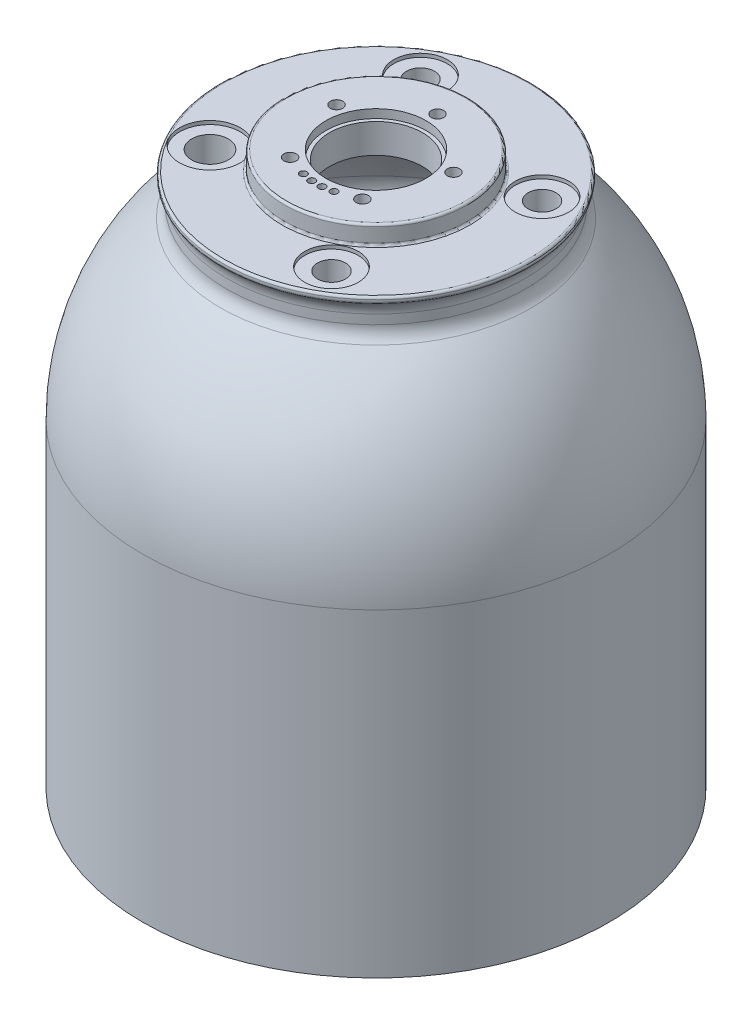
ISO-10303-21;
HEADER;
FILE_DESCRIPTION(('STEP AP214'),'2;1');
FILE_NAME('part.step','',(''),(''),'','','');
FILE_SCHEMA(('AUTOMOTIVE_DESIGN { 1 0 10303 214 1 1 1 1 }'));
ENDSEC;
DATA;
#1=APPLICATION_CONTEXT('core data for automotive mechanical design processes');
#2=APPLICATION_PROTOCOL_DEFINITION('international standard','automotive_design',2000,#1);
#3=PRODUCT_CONTEXT('',#1,'mechanical');
#4=PRODUCT('Part','Part','',(#3));
#5=PRODUCT_RELATED_PRODUCT_CATEGORY('part','',(#4));
#6=PRODUCT_DEFINITION_FORMATION('','',#4);
#7=PRODUCT_DEFINITION_CONTEXT('part definition',#1,'design');
#8=PRODUCT_DEFINITION('design','',#6,#7);
#9=PRODUCT_DEFINITION_SHAPE('','',#8);
#10=(LENGTH_UNIT() NAMED_UNIT(*) SI_UNIT(.MILLI.,.METRE.));
#11=(NAMED_UNIT(*) PLANE_ANGLE_UNIT() SI_UNIT($,.RADIAN.));
#12=(NAMED_UNIT(*) SI_UNIT($,.STERADIAN.) SOLID_ANGLE_UNIT());
#13=UNCERTAINTY_MEASURE_WITH_UNIT(LENGTH_MEASURE(1.E-05),#10,'distance_accuracy_value','');
#14=(GEOMETRIC_REPRESENTATION_CONTEXT(3) GLOBAL_UNCERTAINTY_ASSIGNED_CONTEXT((#13)) GLOBAL_UNIT_ASSIGNED_CONTEXT((#10,
#11,#12)) REPRESENTATION_CONTEXT('',''));
#15=CARTESIAN_POINT('',(0.,0.,0.));
#16=DIRECTION('',(0.,0.,1.));
#17=DIRECTION('',(1.,0.,0.));
#18=AXIS2_PLACEMENT_3D('',#15,#16,#17);
#19=CARTESIAN_POINT('',(-33.3349600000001,192.85204,0.));
#20=DIRECTION('',(0.,-1.,0.));
#21=DIRECTION('',(0.,0.,-1.));
#22=AXIS2_PLACEMENT_3D('',#19,#20,#21);
#23=PLANE('',#22);
#24=CARTESIAN_POINT('',(21.5899999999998,192.85204,37.3949769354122));
#25=DIRECTION('',(0.,1.,0.));
#26=DIRECTION('',(0.,0.,1.));
#27=AXIS2_PLACEMENT_3D('',#24,#25,#26);
#28=CIRCLE('',#27,9.52500000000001);
#29=CARTESIAN_POINT('',(21.5899999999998,192.85204,46.9199769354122));
#30=VERTEX_POINT('',#29);
#31=EDGE_CURVE('E343',#30,#30,#28,.T.);
#32=ORIENTED_EDGE('',*,*,#31,.F.);
#33=EDGE_LOOP('',(#32));
#34=FACE_BOUND('',#33,.T.);
#35=CARTESIAN_POINT('',(-21.5900000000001,192.85204,-37.394976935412));
#36=DIRECTION('',(0.,1.,0.));
#37=DIRECTION('',(0.,0.,1.));
#38=AXIS2_PLACEMENT_3D('',#35,#36,#37);
#39=CIRCLE('',#38,9.52500000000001);
#40=CARTESIAN_POINT('',(-21.5900000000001,192.85204,-27.869976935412));
#41=VERTEX_POINT('',#40);
#42=EDGE_CURVE('E302',#41,#41,#39,.T.);
#43=ORIENTED_EDGE('',*,*,#42,.F.);
#44=EDGE_LOOP('',(#43));
#45=FACE_BOUND('',#44,.T.);
#46=CARTESIAN_POINT('',(0.,192.852037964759,0.));
#47=DIRECTION('',(0.,-1.,0.));
#48=DIRECTION('',(0.,0.,-1.));
#49=AXIS2_PLACEMENT_3D('',#46,#47,#48);
#50=CIRCLE('',#49,54.1324800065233);
#51=CARTESIAN_POINT('',(0.,192.852037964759,-54.1324800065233));
#52=VERTEX_POINT('',#51);
#53=EDGE_CURVE('E49',#52,#52,#50,.T.);
#54=ORIENTED_EDGE('',*,*,#53,.F.);
#55=EDGE_LOOP('',(#54));
#56=FACE_BOUND('',#55,.T.);
#57=CARTESIAN_POINT('',(37.3949769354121,192.85204,-21.5899999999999));
#58=DIRECTION('',(0.,1.,0.));
#59=DIRECTION('',(0.,0.,1.));
#60=AXIS2_PLACEMENT_3D('',#57,#58,#59);
#61=CIRCLE('',#60,9.52500000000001);
#62=CARTESIAN_POINT('',(37.3949769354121,192.85204,-12.0649999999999));
#63=VERTEX_POINT('',#62);
#64=EDGE_CURVE('E276',#63,#63,#61,.T.);
#65=ORIENTED_EDGE('',*,*,#64,.F.);
#66=EDGE_LOOP('',(#65));
#67=FACE_BOUND('',#66,.T.);
#68=CARTESIAN_POINT('',(-37.3949769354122,192.85204,21.5899999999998));
#69=DIRECTION('',(0.,1.,0.));
#70=DIRECTION('',(0.,0.,1.));
#71=AXIS2_PLACEMENT_3D('',#68,#69,#70);
#72=CIRCLE('',#71,10.795);
#73=CARTESIAN_POINT('',(-30.6142842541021,192.85204,13.1903433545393));
#74=VERTEX_POINT('',#73);
#75=CARTESIAN_POINT('',(-26.7303145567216,192.85204,19.9175762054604));
#76=VERTEX_POINT('',#75);
#77=EDGE_CURVE('E55',#74,#76,#72,.T.);
#78=ORIENTED_EDGE('',*,*,#77,.F.);
#79=CARTESIAN_POINT('',(0.,192.85204,0.));
#80=DIRECTION('',(0.,-1.,0.));
#81=DIRECTION('',(0.,0.,-1.));
#82=AXIS2_PLACEMENT_3D('',#79,#80,#81);
#83=CIRCLE('',#82,33.3349600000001);
#84=EDGE_CURVE('E50',#74,#76,#83,.T.);
#85=ORIENTED_EDGE('',*,*,#84,.T.);
#86=EDGE_LOOP('',(#78,#85));
#87=FACE_BOUND('',#86,.T.);
#88=ADVANCED_FACE('F28',(#34,#45,#56,#67,#87),#23,.F.);
#89=CARTESIAN_POINT('',(-70.94474,91.73464,0.));
#90=DIRECTION('',(0.,-1.,0.));
#91=DIRECTION('',(0.,0.,-1.));
#92=AXIS2_PLACEMENT_3D('',#89,#90,#91);
#93=PLANE('',#92);
#94=CARTESIAN_POINT('',(0.,91.73464,0.));
#95=DIRECTION('',(0.,-1.,0.));
#96=DIRECTION('',(0.,0.,-1.));
#97=AXIS2_PLACEMENT_3D('',#94,#95,#96);
#98=CIRCLE('',#97,71.6026);
#99=CARTESIAN_POINT('',(0.,91.73464,-71.6026));
#100=VERTEX_POINT('',#99);
#101=EDGE_CURVE('E861',#100,#100,#98,.T.);
#102=ORIENTED_EDGE('',*,*,#101,.F.);
#103=EDGE_LOOP('',(#102));
#104=FACE_BOUND('',#103,.T.);
#105=CARTESIAN_POINT('',(0.,91.73464,0.));
#106=DIRECTION('',(0.,-1.,0.));
#107=DIRECTION('',(0.,0.,-1.));
#108=AXIS2_PLACEMENT_3D('',#105,#106,#107);
#109=CIRCLE('',#108,70.94474);
#110=CARTESIAN_POINT('',(0.,91.73464,-70.94474));
#111=VERTEX_POINT('',#110);
#112=EDGE_CURVE('E11',#111,#111,#109,.T.);
#113=ORIENTED_EDGE('',*,*,#112,.T.);
#114=EDGE_LOOP('',(#113));
#115=FACE_BOUND('',#114,.T.);
#116=ADVANCED_FACE('F30',(#104,#115),#93,.F.);
#117=CARTESIAN_POINT('',(0.,0.,0.));
#118=DIRECTION('',(0.,-1.,0.));
#119=DIRECTION('',(0.,0.,-1.));
#120=AXIS2_PLACEMENT_3D('',#117,#118,#119);
#121=CYLINDRICAL_SURFACE('',#120,70.94474);
#122=ORIENTED_EDGE('',*,*,#112,.F.);
#123=EDGE_LOOP('',(#122));
#124=FACE_BOUND('',#123,.T.);
#125=CARTESIAN_POINT('',(0.,14.69644,0.));
#126=DIRECTION('',(0.,-1.,0.));
#127=DIRECTION('',(0.,0.,-1.));
#128=AXIS2_PLACEMENT_3D('',#125,#126,#127);
#129=CIRCLE('',#128,70.94474);
#130=CARTESIAN_POINT('',(0.,14.69644,-70.94474));
#131=VERTEX_POINT('',#130);
#132=EDGE_CURVE('E36',#131,#131,#129,.T.);
#133=ORIENTED_EDGE('',*,*,#132,.T.);
#134=EDGE_LOOP('',(#133));
#135=FACE_BOUND('',#134,.T.);
#136=ADVANCED_FACE('F136',(#124,#135),#121,.F.);
#137=CARTESIAN_POINT('',(0.,12.8016,0.));
#138=DIRECTION('',(0.,1.,0.));
#139=DIRECTION('',(0.,0.,1.));
#140=AXIS2_PLACEMENT_3D('',#137,#138,#139);
#141=CONICAL_SURFACE('',#140,69.85,0.523897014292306);
#142=ORIENTED_EDGE('',*,*,#132,.F.);
#143=EDGE_LOOP('',(#142));
#144=FACE_BOUND('',#143,.T.);
#145=CARTESIAN_POINT('',(0.,12.8016,0.));
#146=DIRECTION('',(0.,-1.,0.));
#147=DIRECTION('',(0.,0.,-1.));
#148=AXIS2_PLACEMENT_3D('',#145,#146,#147);
#149=CIRCLE('',#148,69.85);
#150=CARTESIAN_POINT('',(0.,12.8016,-69.85));
#151=VERTEX_POINT('',#150);
#152=EDGE_CURVE('E131',#151,#151,#149,.T.);
#153=ORIENTED_EDGE('',*,*,#152,.T.);
#154=EDGE_LOOP('',(#153));
#155=FACE_BOUND('',#154,.T.);
#156=ADVANCED_FACE('F138',(#144,#155),#141,.F.);
#157=CARTESIAN_POINT('',(0.,0.,0.));
#158=DIRECTION('',(0.,-1.,0.));
#159=DIRECTION('',(0.,0.,-1.));
#160=AXIS2_PLACEMENT_3D('',#157,#158,#159);
#161=CYLINDRICAL_SURFACE('',#160,69.85);
#162=ORIENTED_EDGE('',*,*,#152,.F.);
#163=EDGE_LOOP('',(#162));
#164=FACE_BOUND('',#163,.T.);
#165=CARTESIAN_POINT('',(0.,9.62659999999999,0.));
#166=DIRECTION('',(0.,-1.,0.));
#167=DIRECTION('',(0.,0.,-1.));
#168=AXIS2_PLACEMENT_3D('',#165,#166,#167);
#169=CIRCLE('',#168,69.85);
#170=CARTESIAN_POINT('',(0.,9.62659999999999,-69.85));
#171=VERTEX_POINT('',#170);
#172=EDGE_CURVE('E128',#171,#171,#169,.T.);
#173=ORIENTED_EDGE('',*,*,#172,.T.);
#174=EDGE_LOOP('',(#173));
#175=FACE_BOUND('',#174,.T.);
#176=ADVANCED_FACE('F141',(#164,#175),#161,.F.);
#177=CARTESIAN_POINT('',(-71.6026,9.62659999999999,0.));
#178=DIRECTION('',(0.,1.,0.));
#179=DIRECTION('',(0.,0.,1.));
#180=AXIS2_PLACEMENT_3D('',#177,#178,#179);
#181=PLANE('',#180);
#182=ORIENTED_EDGE('',*,*,#172,.F.);
#183=EDGE_LOOP('',(#182));
#184=FACE_BOUND('',#183,.T.);
#185=CARTESIAN_POINT('',(0.,9.62659999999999,0.));
#186=DIRECTION('',(0.,-1.,0.));
#187=DIRECTION('',(0.,0.,-1.));
#188=AXIS2_PLACEMENT_3D('',#185,#186,#187);
#189=CIRCLE('',#188,71.6026);
#190=CARTESIAN_POINT('',(0.,9.62659999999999,-71.6026));
#191=VERTEX_POINT('',#190);
#192=EDGE_CURVE('E125',#191,#191,#189,.T.);
#193=ORIENTED_EDGE('',*,*,#192,.T.);
#194=EDGE_LOOP('',(#193));
#195=FACE_BOUND('',#194,.T.);
#196=ADVANCED_FACE('F147',(#184,#195),#181,.F.);
#197=CARTESIAN_POINT('',(0.,0.,0.));
#198=DIRECTION('',(0.,-1.,0.));
#199=DIRECTION('',(0.,0.,-1.));
#200=AXIS2_PLACEMENT_3D('',#197,#198,#199);
#201=CYLINDRICAL_SURFACE('',#200,71.6026);
#202=ORIENTED_EDGE('',*,*,#192,.F.);
#203=EDGE_LOOP('',(#202));
#204=FACE_BOUND('',#203,.T.);
#205=CARTESIAN_POINT('',(0.,7.874,0.));
#206=DIRECTION('',(0.,-1.,0.));
#207=DIRECTION('',(0.,0.,-1.));
#208=AXIS2_PLACEMENT_3D('',#205,#206,#207);
#209=CIRCLE('',#208,71.6026);
#210=CARTESIAN_POINT('',(0.,7.874,-71.6026));
#211=VERTEX_POINT('',#210);
#212=EDGE_CURVE('E122',#211,#211,#209,.T.);
#213=ORIENTED_EDGE('',*,*,#212,.T.);
#214=EDGE_LOOP('',(#213));
#215=FACE_BOUND('',#214,.T.);
#216=ADVANCED_FACE('F153',(#204,#215),#201,.F.);
#217=CARTESIAN_POINT('',(-69.85,7.874,0.));
#218=DIRECTION('',(0.,-1.,0.));
#219=DIRECTION('',(0.,0.,-1.));
#220=AXIS2_PLACEMENT_3D('',#217,#218,#219);
#221=PLANE('',#220);
#222=ORIENTED_EDGE('',*,*,#212,.F.);
#223=EDGE_LOOP('',(#222));
#224=FACE_BOUND('',#223,.T.);
#225=CARTESIAN_POINT('',(0.,7.874,0.));
#226=DIRECTION('',(0.,-1.,0.));
#227=DIRECTION('',(0.,0.,-1.));
#228=AXIS2_PLACEMENT_3D('',#225,#226,#227);
#229=CIRCLE('',#228,69.85);
#230=CARTESIAN_POINT('',(0.,7.874,-69.85));
#231=VERTEX_POINT('',#230);
#232=EDGE_CURVE('E119',#231,#231,#229,.T.);
#233=ORIENTED_EDGE('',*,*,#232,.T.);
#234=EDGE_LOOP('',(#233));
#235=FACE_BOUND('',#234,.T.);
#236=ADVANCED_FACE('F159',(#224,#235),#221,.F.);
#237=CARTESIAN_POINT('',(0.,0.,0.));
#238=DIRECTION('',(0.,-1.,0.));
#239=DIRECTION('',(0.,0.,-1.));
#240=AXIS2_PLACEMENT_3D('',#237,#238,#239);
#241=CYLINDRICAL_SURFACE('',#240,69.85);
#242=ORIENTED_EDGE('',*,*,#232,.F.);
#243=EDGE_LOOP('',(#242));
#244=FACE_BOUND('',#243,.T.);
#245=CARTESIAN_POINT('',(0.,3.84948291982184,0.));
#246=DIRECTION('',(0.,-1.,0.));
#247=DIRECTION('',(0.,0.,-1.));
#248=AXIS2_PLACEMENT_3D('',#245,#246,#247);
#249=CIRCLE('',#248,69.85);
#250=CARTESIAN_POINT('',(0.,3.84948291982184,-69.85));
#251=VERTEX_POINT('',#250);
#252=EDGE_CURVE('E116',#251,#251,#249,.T.);
#253=ORIENTED_EDGE('',*,*,#252,.T.);
#254=EDGE_LOOP('',(#253));
#255=FACE_BOUND('',#254,.T.);
#256=ADVANCED_FACE('F165',(#244,#255),#241,.F.);
#257=CARTESIAN_POINT('',(0.,0.,0.));
#258=DIRECTION('',(0.,-1.,0.));
#259=DIRECTION('',(0.,0.,-1.));
#260=AXIS2_PLACEMENT_3D('',#257,#258,#259);
#261=CONICAL_SURFACE('',#260,72.0725,0.523598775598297);
#262=ORIENTED_EDGE('',*,*,#252,.F.);
#263=EDGE_LOOP('',(#262));
#264=FACE_BOUND('',#263,.T.);
#265=CARTESIAN_POINT('',(0.,0.,0.));
#266=DIRECTION('',(0.,-1.,0.));
#267=DIRECTION('',(0.,0.,-1.));
#268=AXIS2_PLACEMENT_3D('',#265,#266,#267);
#269=CIRCLE('',#268,72.0725);
#270=CARTESIAN_POINT('',(0.,0.,-72.0725));
#271=VERTEX_POINT('',#270);
#272=EDGE_CURVE('E113',#271,#271,#269,.T.);
#273=ORIENTED_EDGE('',*,*,#272,.T.);
#274=EDGE_LOOP('',(#273));
#275=FACE_BOUND('',#274,.T.);
#276=ADVANCED_FACE('F171',(#264,#275),#261,.F.);
#277=CARTESIAN_POINT('',(-72.0725,0.,0.));
#278=DIRECTION('',(0.,1.,0.));
#279=DIRECTION('',(0.,0.,1.));
#280=AXIS2_PLACEMENT_3D('',#277,#278,#279);
#281=PLANE('',#280);
#282=ORIENTED_EDGE('',*,*,#272,.F.);
#283=EDGE_LOOP('',(#282));
#284=FACE_BOUND('',#283,.T.);
#285=CARTESIAN_POINT('',(0.,0.,0.));
#286=DIRECTION('',(0.,-1.,0.));
#287=DIRECTION('',(0.,0.,-1.));
#288=AXIS2_PLACEMENT_3D('',#285,#286,#287);
#289=CIRCLE('',#288,73.66);
#290=CARTESIAN_POINT('',(0.,0.,-73.66));
#291=VERTEX_POINT('',#290);
#292=EDGE_CURVE('E110',#291,#291,#289,.T.);
#293=ORIENTED_EDGE('',*,*,#292,.T.);
#294=EDGE_LOOP('',(#293));
#295=FACE_BOUND('',#294,.T.);
#296=ADVANCED_FACE('F177',(#284,#295),#281,.F.);
#297=CARTESIAN_POINT('',(0.,0.,0.));
#298=DIRECTION('',(0.,-1.,0.));
#299=DIRECTION('',(0.,0.,-1.));
#300=AXIS2_PLACEMENT_3D('',#297,#298,#299);
#301=CYLINDRICAL_SURFACE('',#300,73.66);
#302=ORIENTED_EDGE('',*,*,#292,.F.);
#303=EDGE_LOOP('',(#302));
#304=FACE_BOUND('',#303,.T.);
#305=CARTESIAN_POINT('',(0.,3.17499999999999,0.));
#306=DIRECTION('',(0.,-1.,0.));
#307=DIRECTION('',(0.,0.,-1.));
#308=AXIS2_PLACEMENT_3D('',#305,#306,#307);
#309=CIRCLE('',#308,73.66);
#310=CARTESIAN_POINT('',(0.,3.17499999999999,-73.66));
#311=VERTEX_POINT('',#310);
#312=EDGE_CURVE('E107',#311,#311,#309,.T.);
#313=ORIENTED_EDGE('',*,*,#312,.T.);
#314=EDGE_LOOP('',(#313));
#315=FACE_BOUND('',#314,.T.);
#316=ADVANCED_FACE('F183',(#304,#315),#301,.T.);
#317=CARTESIAN_POINT('',(-73.66,3.17499999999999,0.));
#318=DIRECTION('',(0.,1.,0.));
#319=DIRECTION('',(0.,0.,1.));
#320=AXIS2_PLACEMENT_3D('',#317,#318,#319);
#321=PLANE('',#320);
#322=ORIENTED_EDGE('',*,*,#312,.F.);
#323=EDGE_LOOP('',(#322));
#324=FACE_BOUND('',#323,.T.);
#325=CARTESIAN_POINT('',(0.,3.17499999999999,0.));
#326=DIRECTION('',(0.,-1.,0.));
#327=DIRECTION('',(0.,0.,-1.));
#328=AXIS2_PLACEMENT_3D('',#325,#326,#327);
#329=CIRCLE('',#328,76.2);
#330=CARTESIAN_POINT('',(0.,3.17499999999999,-76.2));
#331=VERTEX_POINT('',#330);
#332=EDGE_CURVE('E104',#331,#331,#329,.T.);
#333=ORIENTED_EDGE('',*,*,#332,.T.);
#334=EDGE_LOOP('',(#333));
#335=FACE_BOUND('',#334,.T.);
#336=ADVANCED_FACE('F189',(#324,#335),#321,.F.);
#337=CARTESIAN_POINT('',(0.,0.,0.));
#338=DIRECTION('',(0.,-1.,0.));
#339=DIRECTION('',(0.,0.,-1.));
#340=AXIS2_PLACEMENT_3D('',#337,#338,#339);
#341=CYLINDRICAL_SURFACE('',#340,76.2);
#342=ORIENTED_EDGE('',*,*,#332,.F.);
#343=EDGE_LOOP('',(#342));
#344=FACE_BOUND('',#343,.T.);
#345=CARTESIAN_POINT('',(0.,5.26795999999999,0.));
#346=DIRECTION('',(0.,-1.,0.));
#347=DIRECTION('',(0.,0.,-1.));
#348=AXIS2_PLACEMENT_3D('',#345,#346,#347);
#349=CIRCLE('',#348,76.2);
#350=CARTESIAN_POINT('',(0.,5.26795999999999,-76.2));
#351=VERTEX_POINT('',#350);
#352=EDGE_CURVE('E101',#351,#351,#349,.T.);
#353=ORIENTED_EDGE('',*,*,#352,.T.);
#354=EDGE_LOOP('',(#353));
#355=FACE_BOUND('',#354,.T.);
#356=ADVANCED_FACE('F195',(#344,#355),#341,.T.);
#357=CARTESIAN_POINT('',(-76.2,5.26795999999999,0.));
#358=DIRECTION('',(0.,1.,0.));
#359=DIRECTION('',(0.,0.,1.));
#360=AXIS2_PLACEMENT_3D('',#357,#358,#359);
#361=PLANE('',#360);
#362=ORIENTED_EDGE('',*,*,#352,.F.);
#363=EDGE_LOOP('',(#362));
#364=FACE_BOUND('',#363,.T.);
#365=CARTESIAN_POINT('',(0.,5.26795999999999,0.));
#366=DIRECTION('',(0.,-1.,0.));
#367=DIRECTION('',(0.,0.,-1.));
#368=AXIS2_PLACEMENT_3D('',#365,#366,#367);
#369=CIRCLE('',#368,79.81696);
#370=CARTESIAN_POINT('',(0.,5.26795999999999,-79.81696));
#371=VERTEX_POINT('',#370);
#372=EDGE_CURVE('E98',#371,#371,#369,.T.);
#373=ORIENTED_EDGE('',*,*,#372,.T.);
#374=EDGE_LOOP('',(#373));
#375=FACE_BOUND('',#374,.T.);
#376=ADVANCED_FACE('F201',(#364,#375),#361,.F.);
#377=CARTESIAN_POINT('',(0.,0.,0.));
#378=DIRECTION('',(0.,-1.,0.));
#379=DIRECTION('',(0.,0.,-1.));
#380=AXIS2_PLACEMENT_3D('',#377,#378,#379);
#381=CYLINDRICAL_SURFACE('',#380,79.81696);
#382=ORIENTED_EDGE('',*,*,#372,.F.);
#383=EDGE_LOOP('',(#382));
#384=FACE_BOUND('',#383,.T.);
#385=CARTESIAN_POINT('',(0.,3.17499999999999,0.));
#386=DIRECTION('',(0.,-1.,0.));
#387=DIRECTION('',(0.,0.,-1.));
#388=AXIS2_PLACEMENT_3D('',#385,#386,#387);
#389=CIRCLE('',#388,79.81696);
#390=CARTESIAN_POINT('',(0.,3.17499999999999,-79.81696));
#391=VERTEX_POINT('',#390);
#392=EDGE_CURVE('E95',#391,#391,#389,.T.);
#393=ORIENTED_EDGE('',*,*,#392,.T.);
#394=EDGE_LOOP('',(#393));
#395=FACE_BOUND('',#394,.T.);
#396=ADVANCED_FACE('F207',(#384,#395),#381,.F.);
#397=CARTESIAN_POINT('',(-79.81696,3.17499999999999,0.));
#398=DIRECTION('',(0.,1.,0.));
#399=DIRECTION('',(0.,0.,1.));
#400=AXIS2_PLACEMENT_3D('',#397,#398,#399);
#401=PLANE('',#400);
#402=ORIENTED_EDGE('',*,*,#392,.F.);
#403=EDGE_LOOP('',(#402));
#404=FACE_BOUND('',#403,.T.);
#405=CARTESIAN_POINT('',(0.,3.17499999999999,0.));
#406=DIRECTION('',(0.,-1.,0.));
#407=DIRECTION('',(0.,0.,-1.));
#408=AXIS2_PLACEMENT_3D('',#405,#406,#407);
#409=CIRCLE('',#408,82.90814);
#410=CARTESIAN_POINT('',(0.,3.17499999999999,-82.90814));
#411=VERTEX_POINT('',#410);
#412=EDGE_CURVE('E92',#411,#411,#409,.T.);
#413=ORIENTED_EDGE('',*,*,#412,.T.);
#414=EDGE_LOOP('',(#413));
#415=FACE_BOUND('',#414,.T.);
#416=ADVANCED_FACE('F213',(#404,#415),#401,.F.);
#417=CARTESIAN_POINT('',(0.,0.,0.));
#418=DIRECTION('',(0.,-1.,0.));
#419=DIRECTION('',(0.,0.,-1.));
#420=AXIS2_PLACEMENT_3D('',#417,#418,#419);
#421=CYLINDRICAL_SURFACE('',#420,82.90814);
#422=ORIENTED_EDGE('',*,*,#412,.F.);
#423=EDGE_LOOP('',(#422));
#424=FACE_BOUND('',#423,.T.);
#425=CARTESIAN_POINT('',(0.,116.41074,0.));
#426=DIRECTION('',(0.,-1.,0.));
#427=DIRECTION('',(0.,0.,-1.));
#428=AXIS2_PLACEMENT_3D('',#425,#426,#427);
#429=CIRCLE('',#428,82.90814);
#430=CARTESIAN_POINT('',(0.,116.41074,-82.90814));
#431=VERTEX_POINT('',#430);
#432=EDGE_CURVE('E89',#431,#431,#429,.T.);
#433=ORIENTED_EDGE('',*,*,#432,.T.);
#434=EDGE_LOOP('',(#433));
#435=FACE_BOUND('',#434,.T.);
#436=ADVANCED_FACE('F219',(#424,#435),#421,.T.);
#437=CARTESIAN_POINT('',(0.,116.411260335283,0.));
#438=DIRECTION('',(0.,-1.,0.));
#439=DIRECTION('',(0.,0.,-1.));
#440=AXIS2_PLACEMENT_3D('',#437,#438,#439);
#441=DEGENERATE_TOROIDAL_SURFACE('',#440,0.00127000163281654,82.90687,.T.);
#442=ORIENTED_EDGE('',*,*,#432,.F.);
#443=EDGE_LOOP('',(#442));
#444=FACE_BOUND('',#443,.T.);
#445=CARTESIAN_POINT('',(0.,178.28768,0.));
#446=DIRECTION('',(0.,-1.,0.));
#447=DIRECTION('',(0.,0.,-1.));
#448=AXIS2_PLACEMENT_3D('',#445,#446,#447);
#449=CIRCLE('',#448,55.1815000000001);
#450=CARTESIAN_POINT('',(0.,178.28768,-55.1815000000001));
#451=VERTEX_POINT('',#450);
#452=EDGE_CURVE('E86',#451,#451,#449,.T.);
#453=ORIENTED_EDGE('',*,*,#452,.T.);
#454=EDGE_LOOP('',(#453));
#455=FACE_BOUND('',#454,.T.);
#456=ADVANCED_FACE('F225',(#444,#455),#441,.T.);
#457=CARTESIAN_POINT('',(0.,183.026740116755,0.));
#458=DIRECTION('',(0.,-1.,0.));
#459=DIRECTION('',(0.,0.,-1.));
#460=AXIS2_PLACEMENT_3D('',#457,#458,#459);
#461=TOROIDAL_SURFACE('',#460,59.4080599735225,6.34999999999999);
#462=ORIENTED_EDGE('',*,*,#452,.F.);
#463=EDGE_LOOP('',(#462));
#464=FACE_BOUND('',#463,.T.);
#465=CARTESIAN_POINT('',(0.,183.02732,0.));
#466=DIRECTION('',(0.,-1.,0.));
#467=DIRECTION('',(0.,0.,-1.));
#468=AXIS2_PLACEMENT_3D('',#465,#466,#467);
#469=CIRCLE('',#468,53.0580600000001);
#470=CARTESIAN_POINT('',(0.,183.02732,-53.0580600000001));
#471=VERTEX_POINT('',#470);
#472=EDGE_CURVE('E83',#471,#471,#469,.T.);
#473=ORIENTED_EDGE('',*,*,#472,.T.);
#474=EDGE_LOOP('',(#473));
#475=FACE_BOUND('',#474,.T.);
#476=ADVANCED_FACE('F231',(#464,#475),#461,.F.);
#477=CARTESIAN_POINT('',(0.,0.,0.));
#478=DIRECTION('',(0.,-1.,0.));
#479=DIRECTION('',(0.,0.,-1.));
#480=AXIS2_PLACEMENT_3D('',#477,#478,#479);
#481=CYLINDRICAL_SURFACE('',#480,53.0580600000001);
#482=ORIENTED_EDGE('',*,*,#472,.F.);
#483=EDGE_LOOP('',(#482));
#484=FACE_BOUND('',#483,.T.);
#485=CARTESIAN_POINT('',(0.,186.3344,0.));
#486=DIRECTION('',(0.,-1.,0.));
#487=DIRECTION('',(0.,0.,-1.));
#488=AXIS2_PLACEMENT_3D('',#485,#486,#487);
#489=CIRCLE('',#488,53.0580600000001);
#490=CARTESIAN_POINT('',(0.,186.3344,-53.0580600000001));
#491=VERTEX_POINT('',#490);
#492=EDGE_CURVE('E80',#491,#491,#489,.T.);
#493=ORIENTED_EDGE('',*,*,#492,.T.);
#494=EDGE_LOOP('',(#493));
#495=FACE_BOUND('',#494,.T.);
#496=ADVANCED_FACE('F237',(#484,#495),#481,.T.);
#497=CARTESIAN_POINT('',(0.,186.44034738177,0.));
#498=DIRECTION('',(0.,-1.,0.));
#499=DIRECTION('',(0.,0.,-1.));
#500=AXIS2_PLACEMENT_3D('',#497,#498,#499);
#501=TOROIDAL_SURFACE('',#500,59.407176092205,6.35000000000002);
#502=ORIENTED_EDGE('',*,*,#492,.F.);
#503=EDGE_LOOP('',(#502));
#504=FACE_BOUND('',#503,.T.);
#505=CARTESIAN_POINT('',(0.,190.72352,0.));
#506=DIRECTION('',(0.,-1.,0.));
#507=DIRECTION('',(0.,0.,-1.));
#508=AXIS2_PLACEMENT_3D('',#505,#506,#507);
#509=CIRCLE('',#508,54.7192200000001);
#510=CARTESIAN_POINT('',(0.,190.72352,-54.7192200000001));
#511=VERTEX_POINT('',#510);
#512=EDGE_CURVE('E77',#511,#511,#509,.T.);
#513=ORIENTED_EDGE('',*,*,#512,.T.);
#514=EDGE_LOOP('',(#513));
#515=FACE_BOUND('',#514,.T.);
#516=ADVANCED_FACE('F243',(#504,#515),#501,.F.);
#517=CARTESIAN_POINT('',(0.,191.258996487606,0.));
#518=DIRECTION('',(0.,-1.,0.));
#519=DIRECTION('',(0.,0.,-1.));
#520=AXIS2_PLACEMENT_3D('',#517,#518,#519);
#521=TOROIDAL_SURFACE('',#520,54.1350201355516,0.79247999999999);
#522=ORIENTED_EDGE('',*,*,#512,.F.);
#523=EDGE_LOOP('',(#522));
#524=FACE_BOUND('',#523,.T.);
#525=CARTESIAN_POINT('',(0.,191.25946,0.));
#526=DIRECTION('',(0.,-1.,0.));
#527=DIRECTION('',(0.,0.,-1.));
#528=AXIS2_PLACEMENT_3D('',#525,#526,#527);
#529=CIRCLE('',#528,54.9275000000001);
#530=CARTESIAN_POINT('',(0.,191.25946,-54.9275000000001));
#531=VERTEX_POINT('',#530);
#532=EDGE_CURVE('E74',#531,#531,#529,.T.);
#533=ORIENTED_EDGE('',*,*,#532,.T.);
#534=EDGE_LOOP('',(#533));
#535=FACE_BOUND('',#534,.T.);
#536=ADVANCED_FACE('F249',(#524,#535),#521,.T.);
#537=CARTESIAN_POINT('',(0.,0.,0.));
#538=DIRECTION('',(0.,-1.,0.));
#539=DIRECTION('',(0.,0.,-1.));
#540=AXIS2_PLACEMENT_3D('',#537,#538,#539);
#541=CYLINDRICAL_SURFACE('',#540,54.9275000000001);
#542=ORIENTED_EDGE('',*,*,#532,.F.);
#543=EDGE_LOOP('',(#542));
#544=FACE_BOUND('',#543,.T.);
#545=CARTESIAN_POINT('',(0.,192.05956,0.));
#546=DIRECTION('',(0.,-1.,0.));
#547=DIRECTION('',(0.,0.,-1.));
#548=AXIS2_PLACEMENT_3D('',#545,#546,#547);
#549=CIRCLE('',#548,54.9275000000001);
#550=CARTESIAN_POINT('',(0.,192.05956,-54.9275000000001));
#551=VERTEX_POINT('',#550);
#552=EDGE_CURVE('E71',#551,#551,#549,.T.);
#553=ORIENTED_EDGE('',*,*,#552,.T.);
#554=EDGE_LOOP('',(#553));
#555=FACE_BOUND('',#554,.T.);
#556=ADVANCED_FACE('F255',(#544,#555),#541,.T.);
#557=CARTESIAN_POINT('',(0.,192.05956,0.));
#558=DIRECTION('',(0.,-1.,0.));
#559=DIRECTION('',(0.,0.,-1.));
#560=AXIS2_PLACEMENT_3D('',#557,#558,#559);
#561=TOROIDAL_SURFACE('',#560,54.1350200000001,0.792482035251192);
#562=ORIENTED_EDGE('',*,*,#552,.F.);
#563=EDGE_LOOP('',(#562));
#564=FACE_BOUND('',#563,.T.);
#565=ORIENTED_EDGE('',*,*,#53,.T.);
#566=EDGE_LOOP('',(#565));
#567=FACE_BOUND('',#566,.T.);
#568=ADVANCED_FACE('F261',(#564,#567),#561,.T.);
#569=CARTESIAN_POINT('',(0.,193.64452,0.));
#570=DIRECTION('',(0.,-1.,0.));
#571=DIRECTION('',(0.,0.,-1.));
#572=AXIS2_PLACEMENT_3D('',#569,#570,#571);
#573=TOROIDAL_SURFACE('',#572,33.3349600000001,0.792480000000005);
#574=EDGE_CURVE('E45',#76,#74,#83,.T.);
#575=ORIENTED_EDGE('',*,*,#574,.F.);
#576=ORIENTED_EDGE('',*,*,#84,.F.);
#577=EDGE_LOOP('',(#575,#576));
#578=FACE_BOUND('',#577,.T.);
#579=CARTESIAN_POINT('',(0.,193.64452,0.));
#580=DIRECTION('',(0.,-1.,0.));
#581=DIRECTION('',(0.,0.,-1.));
#582=AXIS2_PLACEMENT_3D('',#579,#580,#581);
#583=CIRCLE('',#582,32.5424800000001);
#584=CARTESIAN_POINT('',(0.,193.64452,-32.5424800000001));
#585=VERTEX_POINT('',#584);
#586=EDGE_CURVE('E63',#585,#585,#583,.T.);
#587=ORIENTED_EDGE('',*,*,#586,.T.);
#588=EDGE_LOOP('',(#587));
#589=FACE_BOUND('',#588,.T.);
#590=ADVANCED_FACE('F61',(#578,#589),#573,.F.);
#591=CARTESIAN_POINT('',(0.,0.,0.));
#592=DIRECTION('',(0.,-1.,0.));
#593=DIRECTION('',(0.,0.,-1.));
#594=AXIS2_PLACEMENT_3D('',#591,#592,#593);
#595=CYLINDRICAL_SURFACE('',#594,32.5424800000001);
#596=ORIENTED_EDGE('',*,*,#586,.F.);
#597=EDGE_LOOP('',(#596));
#598=FACE_BOUND('',#597,.T.);
#599=CARTESIAN_POINT('',(0.,198.66356,0.));
#600=DIRECTION('',(0.,-1.,0.));
#601=DIRECTION('',(0.,0.,-1.));
#602=AXIS2_PLACEMENT_3D('',#599,#600,#601);
#603=CIRCLE('',#602,32.5424800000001);
#604=CARTESIAN_POINT('',(0.,198.66356,-32.5424800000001));
#605=VERTEX_POINT('',#604);
#606=EDGE_CURVE('E65',#605,#605,#603,.T.);
#607=ORIENTED_EDGE('',*,*,#606,.T.);
#608=EDGE_LOOP('',(#607));
#609=FACE_BOUND('',#608,.T.);
#610=ADVANCED_FACE('F668',(#598,#609),#595,.T.);
#611=CARTESIAN_POINT('',(0.,198.66356,0.));
#612=DIRECTION('',(0.,-1.,0.));
#613=DIRECTION('',(0.,0.,-1.));
#614=AXIS2_PLACEMENT_3D('',#611,#612,#613);
#615=TOROIDAL_SURFACE('',#614,31.7500000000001,0.792480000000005);
#616=ORIENTED_EDGE('',*,*,#606,.F.);
#617=EDGE_LOOP('',(#616));
#618=FACE_BOUND('',#617,.T.);
#619=CARTESIAN_POINT('',(0.,199.45604,0.));
#620=DIRECTION('',(0.,-1.,0.));
#621=DIRECTION('',(0.,0.,-1.));
#622=AXIS2_PLACEMENT_3D('',#619,#620,#621);
#623=CIRCLE('',#622,31.7500000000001);
#624=CARTESIAN_POINT('',(0.,199.45604,-31.7500000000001));
#625=VERTEX_POINT('',#624);
#626=EDGE_CURVE('E889',#625,#625,#623,.T.);
#627=ORIENTED_EDGE('',*,*,#626,.T.);
#628=EDGE_LOOP('',(#627));
#629=FACE_BOUND('',#628,.T.);
#630=ADVANCED_FACE('F659',(#618,#629),#615,.T.);
#631=CARTESIAN_POINT('',(-31.7500000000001,199.45604,0.));
#632=DIRECTION('',(0.,-1.,0.));
#633=DIRECTION('',(0.,0.,-1.));
#634=AXIS2_PLACEMENT_3D('',#631,#632,#633);
#635=PLANE('',#634);
#636=CARTESIAN_POINT('',(0.,199.45604,0.));
#637=DIRECTION('',(0.,1.,0.));
#638=DIRECTION('',(0.,0.,1.));
#639=AXIS2_PLACEMENT_3D('',#636,#637,#638);
#640=CIRCLE('',#639,17.78);
#641=CARTESIAN_POINT('',(0.,199.45604,17.78));
#642=VERTEX_POINT('',#641);
#643=EDGE_CURVE('E963',#642,#642,#640,.T.);
#644=ORIENTED_EDGE('',*,*,#643,.F.);
#645=EDGE_LOOP('',(#644));
#646=FACE_BOUND('',#645,.T.);
#647=CARTESIAN_POINT('',(5.45642310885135,199.45604,20.3636482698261));
#648=DIRECTION('',(0.,1.,0.));
#649=DIRECTION('',(0.500000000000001,0.,0.866025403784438));
#650=AXIS2_PLACEMENT_3D('',#647,#648,#649);
#651=CIRCLE('',#650,1.27);
#652=CARTESIAN_POINT('',(6.09142310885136,199.45604,21.4635005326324));
#653=VERTEX_POINT('',#652);
#654=EDGE_CURVE('E957',#653,#653,#651,.T.);
#655=ORIENTED_EDGE('',*,*,#654,.F.);
#656=EDGE_LOOP('',(#655));
#657=FACE_BOUND('',#656,.T.);
#658=CARTESIAN_POINT('',(1.83741736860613,199.45604,21.0017766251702));
#659=DIRECTION('',(0.,1.,0.));
#660=DIRECTION('',(0.342020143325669,0.,0.939692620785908));
#661=AXIS2_PLACEMENT_3D('',#658,#659,#660);
#662=CIRCLE('',#661,1.27);
#663=CARTESIAN_POINT('',(2.27178295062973,199.45604,22.1951862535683));
#664=VERTEX_POINT('',#663);
#665=EDGE_CURVE('E951',#664,#664,#662,.T.);
#666=ORIENTED_EDGE('',*,*,#665,.F.);
#667=EDGE_LOOP('',(#666));
#668=FACE_BOUND('',#667,.T.);
#669=CARTESIAN_POINT('',(-1.83741736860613,199.45604,21.0017766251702));
#670=DIRECTION('',(0.,1.,0.));
#671=DIRECTION('',(0.173648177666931,0.,0.984807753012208));
#672=AXIS2_PLACEMENT_3D('',#669,#670,#671);
#673=CIRCLE('',#672,1.27);
#674=CARTESIAN_POINT('',(-1.61688418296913,199.45604,22.2524824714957));
#675=VERTEX_POINT('',#674);
#676=EDGE_CURVE('E945',#675,#675,#673,.T.);
#677=ORIENTED_EDGE('',*,*,#676,.F.);
#678=EDGE_LOOP('',(#677));
#679=FACE_BOUND('',#678,.T.);
#680=CARTESIAN_POINT('',(-5.45642310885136,199.45604,20.3636482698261));
#681=DIRECTION('',(0.,1.,0.));
#682=DIRECTION('',(0.,0.,1.));
#683=AXIS2_PLACEMENT_3D('',#680,#681,#682);
#684=CIRCLE('',#683,1.27);
#685=CARTESIAN_POINT('',(-5.45642310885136,199.45604,21.6336482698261));
#686=VERTEX_POINT('',#685);
#687=EDGE_CURVE('E939',#686,#686,#684,.T.);
#688=ORIENTED_EDGE('',*,*,#687,.F.);
#689=EDGE_LOOP('',(#688));
#690=FACE_BOUND('',#689,.T.);
#691=CARTESIAN_POINT('',(20.7748785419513,199.45604,-6.75016722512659));
#692=DIRECTION('',(0.,1.,0.));
#693=DIRECTION('',(-0.95105651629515,0.,0.309016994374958));
#694=AXIS2_PLACEMENT_3D('',#691,#692,#693);
#695=CIRCLE('',#694,2.1971);
#696=CARTESIAN_POINT('',(18.6853122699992,199.45604,-6.07122598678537));
#697=VERTEX_POINT('',#696);
#698=EDGE_CURVE('E933',#697,#697,#695,.T.);
#699=ORIENTED_EDGE('',*,*,#698,.F.);
#700=EDGE_LOOP('',(#699));
#701=FACE_BOUND('',#700,.T.);
#702=CARTESIAN_POINT('',(12.8395810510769,199.45604,17.6721672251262));
#703=DIRECTION('',(0.,1.,0.));
#704=DIRECTION('',(-0.58778525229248,0.,-0.809016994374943));
#705=AXIS2_PLACEMENT_3D('',#702,#703,#704);
#706=CIRCLE('',#705,2.1971);
#707=CARTESIAN_POINT('',(11.5481580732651,199.45604,15.8946759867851));
#708=VERTEX_POINT('',#707);
#709=EDGE_CURVE('E927',#708,#708,#706,.T.);
#710=ORIENTED_EDGE('',*,*,#709,.F.);
#711=EDGE_LOOP('',(#710));
#712=FACE_BOUND('',#711,.T.);
#713=CARTESIAN_POINT('',(-12.8395810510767,199.45604,17.6721672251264));
#714=DIRECTION('',(0.,1.,0.));
#715=DIRECTION('',(0.587785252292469,0.,-0.809016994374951));
#716=AXIS2_PLACEMENT_3D('',#713,#714,#715);
#717=CIRCLE('',#716,2.1971);
#718=CARTESIAN_POINT('',(-11.5481580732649,199.45604,15.8946759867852));
#719=VERTEX_POINT('',#718);
#720=EDGE_CURVE('E921',#719,#719,#717,.T.);
#721=ORIENTED_EDGE('',*,*,#720,.F.);
#722=EDGE_LOOP('',(#721));
#723=FACE_BOUND('',#722,.T.);
#724=CARTESIAN_POINT('',(-20.7748785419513,199.45604,-6.75016722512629));
#725=DIRECTION('',(0.,1.,0.));
#726=DIRECTION('',(0.951056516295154,0.,0.309016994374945));
#727=AXIS2_PLACEMENT_3D('',#724,#725,#726);
#728=CIRCLE('',#727,2.1971);
#729=CARTESIAN_POINT('',(-18.6853122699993,199.45604,-6.0712259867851));
#730=VERTEX_POINT('',#729);
#731=EDGE_CURVE('E915',#730,#730,#728,.T.);
#732=ORIENTED_EDGE('',*,*,#731,.F.);
#733=EDGE_LOOP('',(#732));
#734=FACE_BOUND('',#733,.T.);
#735=CARTESIAN_POINT('',(0.,199.45604,-21.844));
#736=DIRECTION('',(0.,1.,0.));
#737=DIRECTION('',(0.,0.,1.));
#738=AXIS2_PLACEMENT_3D('',#735,#736,#737);
#739=CIRCLE('',#738,2.1971);
#740=CARTESIAN_POINT('',(0.,199.45604,-19.6469));
#741=VERTEX_POINT('',#740);
#742=EDGE_CURVE('E871',#741,#741,#739,.T.);
#743=ORIENTED_EDGE('',*,*,#742,.F.);
#744=EDGE_LOOP('',(#743));
#745=FACE_BOUND('',#744,.T.);
#746=ORIENTED_EDGE('',*,*,#626,.F.);
#747=EDGE_LOOP('',(#746));
#748=FACE_BOUND('',#747,.T.);
#749=ADVANCED_FACE('F650',(#646,#657,#668,#679,#690,#701,#712,#723,#734,#745,#748),#635,.F.);
#750=CARTESIAN_POINT('',(-31.0616600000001,185.99404,0.));
#751=DIRECTION('',(0.,1.,0.));
#752=DIRECTION('',(0.,0.,1.));
#753=AXIS2_PLACEMENT_3D('',#750,#751,#752);
#754=PLANE('',#753);
#755=CARTESIAN_POINT('',(0.,185.99404,0.));
#756=DIRECTION('',(0.,1.,0.));
#757=DIRECTION('',(0.,0.,1.));
#758=AXIS2_PLACEMENT_3D('',#755,#756,#757);
#759=CIRCLE('',#758,16.51);
#760=CARTESIAN_POINT('',(0.,185.99404,16.51));
#761=VERTEX_POINT('',#760);
#762=EDGE_CURVE('E965',#761,#761,#759,.F.);
#763=ORIENTED_EDGE('',*,*,#762,.F.);
#764=EDGE_LOOP('',(#763));
#765=FACE_BOUND('',#764,.T.);
#766=CARTESIAN_POINT('',(5.45642310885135,185.99404,20.3636482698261));
#767=DIRECTION('',(0.,1.,0.));
#768=DIRECTION('',(0.,0.,1.));
#769=AXIS2_PLACEMENT_3D('',#766,#767,#768);
#770=CIRCLE('',#769,1.27);
#771=CARTESIAN_POINT('',(5.45642310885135,185.99404,21.6336482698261));
#772=VERTEX_POINT('',#771);
#773=EDGE_CURVE('E954',#772,#772,#770,.F.);
#774=ORIENTED_EDGE('',*,*,#773,.F.);
#775=EDGE_LOOP('',(#774));
#776=FACE_BOUND('',#775,.T.);
#777=CARTESIAN_POINT('',(1.83741736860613,185.99404,21.0017766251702));
#778=DIRECTION('',(0.,1.,0.));
#779=DIRECTION('',(0.,0.,1.));
#780=AXIS2_PLACEMENT_3D('',#777,#778,#779);
#781=CIRCLE('',#780,1.27);
#782=CARTESIAN_POINT('',(1.83741736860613,185.99404,22.2717766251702));
#783=VERTEX_POINT('',#782);
#784=EDGE_CURVE('E948',#783,#783,#781,.F.);
#785=ORIENTED_EDGE('',*,*,#784,.F.);
#786=EDGE_LOOP('',(#785));
#787=FACE_BOUND('',#786,.T.);
#788=CARTESIAN_POINT('',(-1.83741736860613,185.99404,21.0017766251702));
#789=DIRECTION('',(0.,1.,0.));
#790=DIRECTION('',(0.,0.,1.));
#791=AXIS2_PLACEMENT_3D('',#788,#789,#790);
#792=CIRCLE('',#791,1.27);
#793=CARTESIAN_POINT('',(-1.83741736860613,185.99404,22.2717766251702));
#794=VERTEX_POINT('',#793);
#795=EDGE_CURVE('E942',#794,#794,#792,.F.);
#796=ORIENTED_EDGE('',*,*,#795,.F.);
#797=EDGE_LOOP('',(#796));
#798=FACE_BOUND('',#797,.T.);
#799=CARTESIAN_POINT('',(-5.45642310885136,185.99404,20.3636482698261));
#800=DIRECTION('',(0.,1.,0.));
#801=DIRECTION('',(0.,0.,1.));
#802=AXIS2_PLACEMENT_3D('',#799,#800,#801);
#803=CIRCLE('',#802,1.27);
#804=CARTESIAN_POINT('',(-5.45642310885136,185.99404,21.6336482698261));
#805=VERTEX_POINT('',#804);
#806=EDGE_CURVE('E936',#805,#805,#803,.F.);
#807=ORIENTED_EDGE('',*,*,#806,.F.);
#808=EDGE_LOOP('',(#807));
#809=FACE_BOUND('',#808,.T.);
#810=CARTESIAN_POINT('',(20.7748785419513,185.99404,-6.75016722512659));
#811=DIRECTION('',(0.,1.,0.));
#812=DIRECTION('',(0.,0.,1.));
#813=AXIS2_PLACEMENT_3D('',#810,#811,#812);
#814=CIRCLE('',#813,2.1971);
#815=CARTESIAN_POINT('',(20.7748785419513,185.99404,-4.55306722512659));
#816=VERTEX_POINT('',#815);
#817=EDGE_CURVE('E930',#816,#816,#814,.F.);
#818=ORIENTED_EDGE('',*,*,#817,.F.);
#819=EDGE_LOOP('',(#818));
#820=FACE_BOUND('',#819,.T.);
#821=CARTESIAN_POINT('',(12.8395810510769,185.99404,17.6721672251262));
#822=DIRECTION('',(0.,1.,0.));
#823=DIRECTION('',(0.,0.,1.));
#824=AXIS2_PLACEMENT_3D('',#821,#822,#823);
#825=CIRCLE('',#824,2.1971);
#826=CARTESIAN_POINT('',(12.8395810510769,185.99404,19.8692672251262));
#827=VERTEX_POINT('',#826);
#828=EDGE_CURVE('E924',#827,#827,#825,.F.);
#829=ORIENTED_EDGE('',*,*,#828,.F.);
#830=EDGE_LOOP('',(#829));
#831=FACE_BOUND('',#830,.T.);
#832=CARTESIAN_POINT('',(-12.8395810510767,185.99404,17.6721672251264));
#833=DIRECTION('',(0.,1.,0.));
#834=DIRECTION('',(0.,0.,1.));
#835=AXIS2_PLACEMENT_3D('',#832,#833,#834);
#836=CIRCLE('',#835,2.1971);
#837=CARTESIAN_POINT('',(-12.8395810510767,185.99404,19.8692672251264));
#838=VERTEX_POINT('',#837);
#839=EDGE_CURVE('E918',#838,#838,#836,.F.);
#840=ORIENTED_EDGE('',*,*,#839,.F.);
#841=EDGE_LOOP('',(#840));
#842=FACE_BOUND('',#841,.T.);
#843=CARTESIAN_POINT('',(-20.7748785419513,185.99404,-6.75016722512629));
#844=DIRECTION('',(0.,1.,0.));
#845=DIRECTION('',(0.,0.,1.));
#846=AXIS2_PLACEMENT_3D('',#843,#844,#845);
#847=CIRCLE('',#846,2.1971);
#848=CARTESIAN_POINT('',(-20.7748785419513,185.99404,-4.55306722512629));
#849=VERTEX_POINT('',#848);
#850=EDGE_CURVE('E912',#849,#849,#847,.F.);
#851=ORIENTED_EDGE('',*,*,#850,.F.);
#852=EDGE_LOOP('',(#851));
#853=FACE_BOUND('',#852,.T.);
#854=CARTESIAN_POINT('',(0.,185.99404,-21.844));
#855=DIRECTION('',(0.,1.,0.));
#856=DIRECTION('',(0.,0.,1.));
#857=AXIS2_PLACEMENT_3D('',#854,#855,#856);
#858=CIRCLE('',#857,2.1971);
#859=CARTESIAN_POINT('',(0.,185.99404,-19.6469));
#860=VERTEX_POINT('',#859);
#861=EDGE_CURVE('E865',#860,#860,#858,.F.);
#862=ORIENTED_EDGE('',*,*,#861,.F.);
#863=EDGE_LOOP('',(#862));
#864=FACE_BOUND('',#863,.T.);
#865=CARTESIAN_POINT('',(0.,185.99404,0.));
#866=DIRECTION('',(0.,-1.,0.));
#867=DIRECTION('',(0.,0.,-1.));
#868=AXIS2_PLACEMENT_3D('',#865,#866,#867);
#869=CIRCLE('',#868,31.0616600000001);
#870=CARTESIAN_POINT('',(0.,185.99404,-31.0616600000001));
#871=VERTEX_POINT('',#870);
#872=EDGE_CURVE('E886',#871,#871,#869,.T.);
#873=ORIENTED_EDGE('',*,*,#872,.T.);
#874=EDGE_LOOP('',(#873));
#875=FACE_BOUND('',#874,.T.);
#876=ADVANCED_FACE('F641',(#765,#776,#787,#798,#809,#820,#831,#842,#853,#864,#875),#754,.F.);
#877=CARTESIAN_POINT('',(0.,116.411358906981,0.));
#878=DIRECTION('',(0.,-1.,0.));
#879=DIRECTION('',(0.,0.,-1.));
#880=AXIS2_PLACEMENT_3D('',#877,#878,#879);
#881=DEGENERATE_TOROIDAL_SURFACE('',#880,0.00219297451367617,76.2,.T.);
#882=CARTESIAN_POINT('',(-43.4288362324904,174.23818428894,24.013581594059));
#883=CARTESIAN_POINT('',(-43.37292150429,174.222370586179,24.1527862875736));
#884=CARTESIAN_POINT('',(-43.3120188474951,174.210345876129,24.2904647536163));
#885=CARTESIAN_POINT('',(-43.1805649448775,174.194082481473,24.5616843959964));
#886=CARTESIAN_POINT('',(-43.1100084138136,174.189848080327,24.6952232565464));
#887=CARTESIAN_POINT('',(-42.9596222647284,174.189245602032,24.9573121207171));
#888=CARTESIAN_POINT('',(-42.8797765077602,174.192891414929,25.0858529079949));
#889=CARTESIAN_POINT('',(-42.7115496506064,174.208017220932,25.3367419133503));
#890=CARTESIAN_POINT('',(-42.6231681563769,174.219497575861,25.459089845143));
#891=CARTESIAN_POINT('',(-42.4388805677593,174.250059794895,25.6964283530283));
#892=CARTESIAN_POINT('',(-42.3429957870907,174.269120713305,25.8114381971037));
#893=CARTESIAN_POINT('',(-42.144314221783,174.314543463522,26.0337858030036));
#894=CARTESIAN_POINT('',(-42.0415171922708,174.340905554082,26.1411232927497));
#895=CARTESIAN_POINT('',(-41.8299271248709,174.400525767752,26.3475476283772));
#896=CARTESIAN_POINT('',(-41.7211368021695,174.433780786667,26.446638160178));
#897=CARTESIAN_POINT('',(-41.4983481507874,174.506751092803,26.6362820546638));
#898=CARTESIAN_POINT('',(-41.3843479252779,174.546468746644,26.7268322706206));
#899=CARTESIAN_POINT('',(-41.1482869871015,174.633234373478,26.9018870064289));
#900=CARTESIAN_POINT('',(-41.0260850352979,174.680476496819,26.9861047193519));
#901=CARTESIAN_POINT('',(-40.7779222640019,174.780753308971,27.1450540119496));
#902=CARTESIAN_POINT('',(-40.6519601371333,174.833790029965,27.21978224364));
#903=CARTESIAN_POINT('',(-40.2696860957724,175.000746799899,27.4296642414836));
#904=CARTESIAN_POINT('',(-40.0088774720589,175.122553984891,27.5505951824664));
#905=CARTESIAN_POINT('',(-39.4392257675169,175.403541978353,27.771419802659));
#906=CARTESIAN_POINT('',(-39.1293444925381,175.565585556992,27.8649014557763));
#907=CARTESIAN_POINT('',(-38.5081305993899,175.906409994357,28.0043241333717));
#908=CARTESIAN_POINT('',(-38.1967971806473,176.085201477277,28.0502347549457));
#909=CARTESIAN_POINT('',(-37.5175445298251,176.490921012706,28.1018113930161));
#910=CARTESIAN_POINT('',(-37.1504362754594,176.720434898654,28.0978779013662));
#911=CARTESIAN_POINT('',(-36.4288491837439,177.19015065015,28.0304465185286));
#912=CARTESIAN_POINT('',(-36.0743781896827,177.430358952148,27.966912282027));
#913=CARTESIAN_POINT('',(-35.3265410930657,177.956679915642,27.7686727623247));
#914=CARTESIAN_POINT('',(-34.9364774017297,178.24379730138,27.6239094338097));
#915=CARTESIAN_POINT('',(-34.3774547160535,178.674263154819,27.3535715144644));
#916=CARTESIAN_POINT('',(-34.1953282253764,178.817827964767,27.2544958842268));
#917=CARTESIAN_POINT('',(-33.8407890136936,179.104142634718,27.0390325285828));
#918=CARTESIAN_POINT('',(-33.6683776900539,179.246892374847,26.9226423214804));
#919=CARTESIAN_POINT('',(-33.3228203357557,179.540629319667,26.6642999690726));
#920=CARTESIAN_POINT('',(-33.1504788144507,179.691488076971,26.5211244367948));
#921=CARTESIAN_POINT('',(-32.8201226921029,179.989999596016,26.2162730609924));
#922=CARTESIAN_POINT('',(-32.6621020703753,180.137653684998,26.054605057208));
#923=CARTESIAN_POINT('',(-32.3621811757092,180.42851486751,25.7135554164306));
#924=CARTESIAN_POINT('',(-32.22027016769,180.571724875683,25.5341857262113));
#925=CARTESIAN_POINT('',(-31.9544113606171,180.852457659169,25.1585245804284));
#926=CARTESIAN_POINT('',(-31.8304576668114,180.989982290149,24.9622387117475));
#927=CARTESIAN_POINT('',(-31.628897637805,181.226975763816,24.6009630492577));
#928=CARTESIAN_POINT('',(-31.5471963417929,181.327904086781,24.4392014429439));
#929=CARTESIAN_POINT('',(-31.3966659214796,181.524827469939,24.1068899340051));
#930=CARTESIAN_POINT('',(-31.3278366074,181.62082260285,23.936340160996));
#931=CARTESIAN_POINT('',(-31.2041237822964,181.807083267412,23.5872089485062));
#932=CARTESIAN_POINT('',(-31.1492409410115,181.897348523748,23.4086271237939));
#933=CARTESIAN_POINT('',(-31.0545401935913,182.071248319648,23.0444568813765));
#934=CARTESIAN_POINT('',(-31.0147156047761,182.154885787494,22.858871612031));
#935=CARTESIAN_POINT('',(-30.9508915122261,182.315387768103,22.4800532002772));
#936=CARTESIAN_POINT('',(-30.9270398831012,182.392183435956,22.286765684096));
#937=CARTESIAN_POINT('',(-30.8968101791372,182.537105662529,21.8957187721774));
#938=CARTESIAN_POINT('',(-30.8904224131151,182.605237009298,21.6979619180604));
#939=CARTESIAN_POINT('',(-30.8960093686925,182.731840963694,21.2997297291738));
#940=CARTESIAN_POINT('',(-30.9079737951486,182.790318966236,21.0992559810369));
#941=CARTESIAN_POINT('',(-30.9509486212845,182.896676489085,20.6975417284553));
#942=CARTESIAN_POINT('',(-30.9819547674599,182.944558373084,20.4963014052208));
#943=CARTESIAN_POINT('',(-31.0572941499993,183.022541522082,20.1253251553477));
#944=CARTESIAN_POINT('',(-31.0989444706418,183.054230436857,19.9553739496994));
#945=CARTESIAN_POINT('',(-31.1962947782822,183.108839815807,19.6181139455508));
#946=CARTESIAN_POINT('',(-31.2519925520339,183.131761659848,19.4508047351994));
#947=CARTESIAN_POINT('',(-31.3771661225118,183.16846939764,19.1205204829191));
#948=CARTESIAN_POINT('',(-31.4466323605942,183.182261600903,18.9575425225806));
#949=CARTESIAN_POINT('',(-31.5988824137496,183.200509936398,18.6373904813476));
#950=CARTESIAN_POINT('',(-31.6816651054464,183.204966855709,18.480215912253));
#951=CARTESIAN_POINT('',(-31.8494118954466,183.204503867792,18.1911022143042));
#952=CARTESIAN_POINT('',(-31.932996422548,183.200616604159,18.0583573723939));
#953=CARTESIAN_POINT('',(-32.1093259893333,183.185555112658,17.7995363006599));
#954=CARTESIAN_POINT('',(-32.2020706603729,183.174381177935,17.6734598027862));
#955=CARTESIAN_POINT('',(-32.3959389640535,183.14489073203,17.4288489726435));
#956=CARTESIAN_POINT('',(-32.497061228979,183.126575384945,17.3103134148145));
#957=CARTESIAN_POINT('',(-32.7068491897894,183.083028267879,17.0814789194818));
#958=CARTESIAN_POINT('',(-32.8155150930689,183.057796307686,16.9711802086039));
#959=CARTESIAN_POINT('',(-33.0386673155,183.000919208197,16.7601789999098));
#960=CARTESIAN_POINT('',(-33.1531048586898,182.969322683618,16.6594117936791));
#961=CARTESIAN_POINT('',(-33.3876316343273,182.899947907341,16.4669701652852));
#962=CARTESIAN_POINT('',(-33.5077227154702,182.862167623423,16.3752987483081));
#963=CARTESIAN_POINT('',(-33.8750801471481,182.740118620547,16.1144579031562));
#964=CARTESIAN_POINT('',(-34.129586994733,182.647101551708,15.959315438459));
#965=CARTESIAN_POINT('',(-34.6735686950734,182.432066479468,15.6758258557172));
#966=CARTESIAN_POINT('',(-34.9641500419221,182.308216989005,15.5510369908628));
#967=CARTESIAN_POINT('',(-35.5520868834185,182.041080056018,15.3464483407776));
#968=CARTESIAN_POINT('',(-35.8494455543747,181.897783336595,15.2666701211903));
#969=CARTESIAN_POINT('',(-36.4885301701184,181.573314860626,15.1416963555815));
#970=CARTESIAN_POINT('',(-36.8303319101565,181.389674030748,15.1033360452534));
#971=CARTESIAN_POINT('',(-37.5069987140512,181.006987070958,15.0797429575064));
#972=CARTESIAN_POINT('',(-37.8418596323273,180.807932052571,15.0945410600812));
#973=CARTESIAN_POINT('',(-38.5535283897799,180.364623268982,15.1800170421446));
#974=CARTESIAN_POINT('',(-38.9280239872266,180.118366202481,15.259598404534));
#975=CARTESIAN_POINT('',(-39.6519788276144,179.616732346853,15.4801302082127));
#976=CARTESIAN_POINT('',(-40.0014245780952,179.361350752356,15.621113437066));
#977=CARTESIAN_POINT('',(-40.7140000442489,178.811937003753,15.9823505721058));
#978=CARTESIAN_POINT('',(-41.0725879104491,178.517349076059,16.2107470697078));
#979=CARTESIAN_POINT('',(-41.7405298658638,177.930411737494,16.7343291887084));
#980=CARTESIAN_POINT('',(-42.0498360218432,177.638064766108,17.0295791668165));
#981=CARTESIAN_POINT('',(-42.4751349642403,177.201557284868,17.5250978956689));
#982=CARTESIAN_POINT('',(-42.612927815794,177.053273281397,17.7034318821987));
#983=CARTESIAN_POINT('',(-42.8706775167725,176.761052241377,18.075849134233));
#984=CARTESIAN_POINT('',(-42.9906316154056,176.617115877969,18.2699348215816));
#985=CARTESIAN_POINT('',(-43.3206913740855,176.194532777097,18.8739371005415));
#986=CARTESIAN_POINT('',(-43.5018595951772,175.924227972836,19.3065925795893));
#987=CARTESIAN_POINT('',(-43.7293760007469,175.497468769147,20.0840010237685));
#988=CARTESIAN_POINT('',(-43.7998381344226,175.331137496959,20.4163610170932));
#989=CARTESIAN_POINT('',(-43.8659334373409,175.100935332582,20.9285026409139));
#990=CARTESIAN_POINT('',(-43.8813651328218,175.027410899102,21.1015008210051));
#991=CARTESIAN_POINT('',(-43.8982475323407,174.887700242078,21.4511336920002));
#992=CARTESIAN_POINT('',(-43.8997005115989,174.821512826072,21.627767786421));
#993=CARTESIAN_POINT('',(-43.8887898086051,174.706802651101,21.9566901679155));
#994=CARTESIAN_POINT('',(-43.8784713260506,174.65712030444,22.1086444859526));
#995=CARTESIAN_POINT('',(-43.8468480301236,174.564381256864,22.4134221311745));
#996=CARTESIAN_POINT('',(-43.825545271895,174.521323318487,22.5662452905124));
#997=CARTESIAN_POINT('',(-43.7717465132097,174.442521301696,22.8713903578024));
#998=CARTESIAN_POINT('',(-43.7392787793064,174.406759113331,23.0237125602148));
#999=CARTESIAN_POINT('',(-43.6630084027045,174.342973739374,23.3270714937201));
#1000=CARTESIAN_POINT('',(-43.6192128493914,174.314945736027,23.4781089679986));
#1001=CARTESIAN_POINT('',(-43.5483954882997,174.280658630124,23.6926909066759));
#1002=CARTESIAN_POINT('',(-43.5259554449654,174.271071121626,23.7572546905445));
#1003=CARTESIAN_POINT('',(-43.4789709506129,174.253452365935,23.885846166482));
#1004=CARTESIAN_POINT('',(-43.4544259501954,174.24542152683,23.949873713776));
#1005=CARTESIAN_POINT('',(-43.4288362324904,174.23818428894,24.013581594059));
#1006=B_SPLINE_CURVE_WITH_KNOTS('',3,(#882,#883,#884,#885,#886,#887,#888,#889,#890,#891,#892,
#893,#894,#895,#896,#897,#898,#899,#900,#901,#902,#903,#904,#905,#906,#907,#908,#909,#910,#911,
#912,#913,#914,#915,#916,#917,#918,#919,#920,#921,#922,#923,#924,#925,#926,#927,#928,#929,#930,
#931,#932,#933,#934,#935,#936,#937,#938,#939,#940,#941,#942,#943,#944,#945,#946,#947,#948,#949,
#950,#951,#952,#953,#954,#955,#956,#957,#958,#959,#960,#961,#962,#963,#964,#965,#966,#967,#968,
#969,#970,#971,#972,#973,#974,#975,#976,#977,#978,#979,#980,#981,#982,#983,#984,#985,#986,#987,
#988,#989,#990,#991,#992,#993,#994,#995,#996,#997,#998,#999,#1000,#1001,#1002,#1003,#1004,
#1005),.UNSPECIFIED.,.T.,.F.,(4,2,2,2,2,2,2,2,2,2,2,2,2,2,2,2,2,2,2,2,2,2,2,2,2,2,2,2,2,2,2,2,2,
2,2,2,2,2,2,2,2,2,2,2,2,2,2,2,2,2,2,2,2,2,2,2,2,2,2,2,2,4),(0.,0.452470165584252,
0.90518904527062,1.35870655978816,1.81224502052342,2.264538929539,2.71684886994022,
3.16895555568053,3.62122817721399,4.08799724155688,4.55493053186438,5.4883778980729,
6.57039783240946,7.65310886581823,8.94706135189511,10.2418034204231,11.751327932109,
12.5072633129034,13.2633071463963,14.0726321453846,14.8816153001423,15.6900561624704,
16.4982310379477,17.1199413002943,17.7416423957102,18.3633733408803,18.9848280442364,
19.611959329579,20.2387425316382,20.8651742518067,21.4914660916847,22.0241960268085,
22.5568420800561,23.0891196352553,23.6213523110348,24.0915330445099,24.5616948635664,
25.0317800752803,25.5018782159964,25.96851318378,26.4353018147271,27.3682324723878,
28.3832410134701,29.3987354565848,30.563991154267,31.729923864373,33.0902071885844,
34.4512177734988,35.9963108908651,37.542897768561,38.3512420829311,39.1597109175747,
40.7719564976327,41.9021784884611,42.4673986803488,43.0325268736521,43.5126580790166,
43.9926994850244,44.4715344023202,44.9500703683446,45.1570919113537,45.3641676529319),.UNSPECIFIED.);
#1007=CARTESIAN_POINT('',(-43.4288362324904,174.23818428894,24.013581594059));
#1008=VERTEX_POINT('',#1007);
#1009=EDGE_CURVE('E57',#1008,#1008,#1006,.T.);
#1010=ORIENTED_EDGE('',*,*,#1009,.T.);
#1011=EDGE_LOOP('',(#1010));
#1012=FACE_BOUND('',#1011,.T.);
#1013=CARTESIAN_POINT('',(24.7307547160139,175.52769202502,41.2346918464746));
#1014=CARTESIAN_POINT('',(24.8297786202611,175.542759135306,41.1537000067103));
#1015=CARTESIAN_POINT('',(24.9253023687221,175.561343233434,41.0691605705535));
#1016=CARTESIAN_POINT('',(25.108810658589,175.605202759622,40.8938078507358));
#1017=CARTESIAN_POINT('',(25.1967935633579,175.630479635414,40.8029932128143));
#1018=CARTESIAN_POINT('',(25.3647566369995,175.687315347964,40.6159666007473));
#1019=CARTESIAN_POINT('',(25.4447306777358,175.718878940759,40.519750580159));
#1020=CARTESIAN_POINT('',(25.5963196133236,175.787784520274,40.3228796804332));
#1021=CARTESIAN_POINT('',(25.667930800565,175.825129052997,40.2222228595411));
#1022=CARTESIAN_POINT('',(25.8689666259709,175.944504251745,39.9163526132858));
#1023=CARTESIAN_POINT('',(25.9858765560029,176.03432440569,39.7057904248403));
#1024=CARTESIAN_POINT('',(26.1858998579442,176.230564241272,39.2768904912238));
#1025=CARTESIAN_POINT('',(26.2690117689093,176.336984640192,39.0585524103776));
#1026=CARTESIAN_POINT('',(26.4106456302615,176.576066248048,38.5929097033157));
#1027=CARTESIAN_POINT('',(26.4651375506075,176.710341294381,38.3452125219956));
#1028=CARTESIAN_POINT('',(26.5359127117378,176.990735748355,37.8511463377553));
#1029=CARTESIAN_POINT('',(26.5521740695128,177.136861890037,37.604778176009));
#1030=CARTESIAN_POINT('',(26.5485100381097,177.466612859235,37.0700594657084));
#1031=CARTESIAN_POINT('',(26.52094593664,177.652009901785,36.7828448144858));
#1032=CARTESIAN_POINT('',(26.41833056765,178.029626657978,36.2217448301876));
#1033=CARTESIAN_POINT('',(26.3432489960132,178.221850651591,35.9478681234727));
#1034=CARTESIAN_POINT('',(26.1341037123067,178.637649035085,35.3791491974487));
#1035=CARTESIAN_POINT('',(25.9929747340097,178.861666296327,35.0871712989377));
#1036=CARTESIAN_POINT('',(25.7403184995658,179.195778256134,34.6730570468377));
#1037=CARTESIAN_POINT('',(25.6491843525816,179.306917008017,34.5388978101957));
#1038=CARTESIAN_POINT('',(25.4535988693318,179.527932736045,34.2794139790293));
#1039=CARTESIAN_POINT('',(25.3491457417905,179.637809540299,34.1540905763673));
#1040=CARTESIAN_POINT('',(25.1225831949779,179.860223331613,33.9081784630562));
#1041=CARTESIAN_POINT('',(24.9999043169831,179.97266887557,33.7880311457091));
#1042=CARTESIAN_POINT('',(24.7411263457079,180.194393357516,33.559888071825));
#1043=CARTESIAN_POINT('',(24.6050285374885,180.303672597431,33.4518911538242));
#1044=CARTESIAN_POINT('',(24.3201832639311,180.517962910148,33.2495804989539));
#1045=CARTESIAN_POINT('',(24.1714506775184,180.622978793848,33.1552510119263));
#1046=CARTESIAN_POINT('',(23.8621301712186,180.827692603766,32.9817405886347));
#1047=CARTESIAN_POINT('',(23.7015470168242,180.927392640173,32.9025536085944));
#1048=CARTESIAN_POINT('',(23.2914702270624,181.165564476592,32.7277641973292));
#1049=CARTESIAN_POINT('',(23.0355126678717,181.300367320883,32.6417993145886));
#1050=CARTESIAN_POINT('',(22.6375781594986,181.488583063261,32.5443010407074));
#1051=CARTESIAN_POINT('',(22.5025512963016,181.549008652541,32.5170391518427));
#1052=CARTESIAN_POINT('',(22.2285322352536,181.664619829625,32.4736727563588));
#1053=CARTESIAN_POINT('',(22.0895417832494,181.71980767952,32.4575634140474));
#1054=CARTESIAN_POINT('',(21.8072790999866,181.824758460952,32.4370798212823));
#1055=CARTESIAN_POINT('',(21.6639800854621,181.874469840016,32.4328092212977));
#1056=CARTESIAN_POINT('',(21.3754755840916,181.96721195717,32.4369001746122));
#1057=CARTESIAN_POINT('',(21.230271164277,182.010246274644,32.4452549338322));
#1058=CARTESIAN_POINT('',(20.9392776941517,182.088982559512,32.4750489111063));
#1059=CARTESIAN_POINT('',(20.7934889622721,182.124688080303,32.4964817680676));
#1060=CARTESIAN_POINT('',(20.5027665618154,182.18817466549,32.5527067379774));
#1061=CARTESIAN_POINT('',(20.357832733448,182.215957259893,32.5874962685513));
#1062=CARTESIAN_POINT('',(20.0906689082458,182.259766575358,32.6646193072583));
#1063=CARTESIAN_POINT('',(19.9681121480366,182.276897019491,32.7052041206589));
#1064=CARTESIAN_POINT('',(19.7259109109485,182.304673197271,32.7961024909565));
#1065=CARTESIAN_POINT('',(19.6062660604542,182.315319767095,32.846414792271));
#1066=CARTESIAN_POINT('',(19.3710257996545,182.32996082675,32.9564234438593));
#1067=CARTESIAN_POINT('',(19.2554282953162,182.333958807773,33.0161148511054));
#1068=CARTESIAN_POINT('',(19.0292577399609,182.335249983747,33.1444181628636));
#1069=CARTESIAN_POINT('',(18.9186844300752,182.332543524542,33.2130296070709));
#1070=CARTESIAN_POINT('',(18.7136855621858,182.321041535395,33.3516611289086));
#1071=CARTESIAN_POINT('',(18.6187210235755,182.312844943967,33.4209367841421));
#1072=CARTESIAN_POINT('',(18.4342915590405,182.291092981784,33.56574672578));
#1073=CARTESIAN_POINT('',(18.3448283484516,182.277535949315,33.6412829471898));
#1074=CARTESIAN_POINT('',(18.1720077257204,182.245237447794,33.7979396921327));
#1075=CARTESIAN_POINT('',(18.0886477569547,182.226498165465,33.8790578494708));
#1076=CARTESIAN_POINT('',(17.9283904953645,182.184046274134,34.0462778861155));
#1077=CARTESIAN_POINT('',(17.8514956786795,182.160331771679,34.1323816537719));
#1078=CARTESIAN_POINT('',(17.7032133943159,182.107727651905,34.3104511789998));
#1079=CARTESIAN_POINT('',(17.6319487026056,182.078753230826,34.4024941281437));
#1080=CARTESIAN_POINT('',(17.4967040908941,182.016232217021,34.5903215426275));
#1081=CARTESIAN_POINT('',(17.432726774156,181.982683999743,34.6861073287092));
#1082=CARTESIAN_POINT('',(17.2519913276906,181.875669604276,34.9780109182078));
#1083=CARTESIAN_POINT('',(17.1463380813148,181.795800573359,35.1787861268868));
#1084=CARTESIAN_POINT('',(16.9552538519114,181.612381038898,35.6094048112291));
#1085=CARTESIAN_POINT('',(16.8732320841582,181.507205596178,35.8400481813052));
#1086=CARTESIAN_POINT('',(16.7447668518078,181.28273447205,36.3043171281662));
#1087=CARTESIAN_POINT('',(16.6983418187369,181.163431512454,36.5379441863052));
#1088=CARTESIAN_POINT('',(16.6345944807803,180.893942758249,37.0405121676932));
#1089=CARTESIAN_POINT('',(16.6230664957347,180.741861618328,37.3091676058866));
#1090=CARTESIAN_POINT('',(16.6421456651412,180.426986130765,37.838536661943));
#1091=CARTESIAN_POINT('',(16.6727779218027,180.26418545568,38.0992454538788));
#1092=CARTESIAN_POINT('',(16.7813623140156,179.903753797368,38.650425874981));
#1093=CARTESIAN_POINT('',(16.8663118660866,179.704820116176,38.9386747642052));
#1094=CARTESIAN_POINT('',(17.0847473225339,179.301906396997,39.4923853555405));
#1095=CARTESIAN_POINT('',(17.2182596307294,179.097923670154,39.7578345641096));
#1096=CARTESIAN_POINT('',(17.5482622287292,178.665404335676,40.2900271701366));
#1097=CARTESIAN_POINT('',(17.7502957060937,178.436789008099,40.5532836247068));
#1098=CARTESIAN_POINT('',(18.205943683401,177.984759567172,41.0372794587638));
#1099=CARTESIAN_POINT('',(18.4596054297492,177.761350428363,41.2579795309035));
#1100=CARTESIAN_POINT('',(18.8761057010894,177.435094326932,41.5509067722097));
#1101=CARTESIAN_POINT('',(19.0217666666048,177.327298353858,41.6425590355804));
#1102=CARTESIAN_POINT('',(19.3243527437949,177.116063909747,41.8113778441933));
#1103=CARTESIAN_POINT('',(19.4812795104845,177.012626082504,41.888542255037));
#1104=CARTESIAN_POINT('',(19.8052021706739,176.811626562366,42.0267345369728));
#1105=CARTESIAN_POINT('',(19.9721771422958,176.714053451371,42.0877946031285));
#1106=CARTESIAN_POINT('',(20.3152613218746,176.526086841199,42.1923695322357));
#1107=CARTESIAN_POINT('',(20.491365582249,176.435689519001,42.2358937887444));
#1108=CARTESIAN_POINT('',(20.9128625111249,176.234344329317,42.3152810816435));
#1109=CARTESIAN_POINT('',(21.1614760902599,176.126842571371,42.3435230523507));
#1110=CARTESIAN_POINT('',(21.5410629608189,175.980948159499,42.3569775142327));
#1111=CARTESIAN_POINT('',(21.6687400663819,175.934865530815,42.3566400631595));
#1112=CARTESIAN_POINT('',(21.9255708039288,175.848398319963,42.3458992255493));
#1113=CARTESIAN_POINT('',(22.0547236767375,175.808010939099,42.3355008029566));
#1114=CARTESIAN_POINT('',(22.3147163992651,175.733210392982,42.3041351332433));
#1115=CARTESIAN_POINT('',(22.4455611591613,175.698852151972,42.2830768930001));
#1116=CARTESIAN_POINT('',(22.7066519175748,175.63714913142,42.2301160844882));
#1117=CARTESIAN_POINT('',(22.8368981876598,175.609800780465,42.1982190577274));
#1118=CARTESIAN_POINT('',(23.0955155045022,175.562641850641,42.1235353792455));
#1119=CARTESIAN_POINT('',(23.2238880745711,175.542824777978,42.0807581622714));
#1120=CARTESIAN_POINT('',(23.4774950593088,175.511108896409,41.9844781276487));
#1121=CARTESIAN_POINT('',(23.6027303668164,175.499207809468,41.93097840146));
#1122=CARTESIAN_POINT('',(23.9052247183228,175.480009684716,41.7866662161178));
#1123=CARTESIAN_POINT('',(24.0800360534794,175.477318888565,41.6899877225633));
#1124=CARTESIAN_POINT('',(24.416269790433,175.489516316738,41.4765940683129));
#1125=CARTESIAN_POINT('',(24.5776935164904,175.504402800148,41.3598808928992));
#1126=CARTESIAN_POINT('',(24.7307547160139,175.52769202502,41.2346918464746));
#1127=B_SPLINE_CURVE_WITH_KNOTS('',3,(#1013,#1014,#1015,#1016,#1017,#1018,#1019,#1020,#1021,
#1022,#1023,#1024,#1025,#1026,#1027,#1028,#1029,#1030,#1031,#1032,#1033,#1034,#1035,#1036,#1037,
#1038,#1039,#1040,#1041,#1042,#1043,#1044,#1045,#1046,#1047,#1048,#1049,#1050,#1051,#1052,#1053,
#1054,#1055,#1056,#1057,#1058,#1059,#1060,#1061,#1062,#1063,#1064,#1065,#1066,#1067,#1068,#1069,
#1070,#1071,#1072,#1073,#1074,#1075,#1076,#1077,#1078,#1079,#1080,#1081,#1082,#1083,#1084,#1085,
#1086,#1087,#1088,#1089,#1090,#1091,#1092,#1093,#1094,#1095,#1096,#1097,#1098,#1099,#1100,#1101,
#1102,#1103,#1104,#1105,#1106,#1107,#1108,#1109,#1110,#1111,#1112,#1113,#1114,#1115,#1116,#1117,
#1118,#1119,#1120,#1121,#1122,#1123,#1124,#1125,#1126),.UNSPECIFIED.,.T.,.F.,(4,2,2,2,2,2,2,2,2,
2,2,2,2,2,2,2,2,2,2,2,2,2,2,2,2,2,2,2,2,2,2,2,2,2,2,2,2,2,2,2,2,2,2,2,2,2,2,2,2,2,2,2,2,2,2,2,
4),(0.,0.386214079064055,0.772511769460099,1.15910282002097,1.54586461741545,2.31350312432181,
3.08117480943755,3.93893036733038,4.79717678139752,5.82205367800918,6.84758484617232,
8.02435106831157,8.61366653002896,9.20306133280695,9.81803033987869,10.4329405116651,
11.047136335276,11.6610865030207,12.5621112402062,13.0129347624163,13.4635626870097,
13.9181236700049,14.3724401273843,14.8265357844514,15.280543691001,15.6707107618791,
16.0608275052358,16.4507393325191,16.8406310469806,17.1937162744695,17.5469110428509,
17.8999570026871,18.2531375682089,18.6126210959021,18.9722326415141,19.6910169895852,
20.4873109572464,21.2840169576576,22.2072777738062,23.1310885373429,24.2079142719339,
25.2853263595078,26.4888776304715,27.6935352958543,28.3020258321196,28.9106059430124,
29.5179600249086,30.1249883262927,30.9381592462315,31.3449749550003,31.7515900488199,
32.1617360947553,32.5716727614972,32.9812551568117,33.3907196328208,33.9877496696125,
34.5847205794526),.UNSPECIFIED.);
#1128=CARTESIAN_POINT('',(24.7307547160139,175.52769202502,41.2346918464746));
#1129=VERTEX_POINT('',#1128);
#1130=EDGE_CURVE('E279',#1129,#1129,#1127,.T.);
#1131=ORIENTED_EDGE('',*,*,#1130,.T.);
#1132=EDGE_LOOP('',(#1131));
#1133=FACE_BOUND('',#1132,.T.);
#1134=CARTESIAN_POINT('',(41.2346918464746,175.52769202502,-24.730754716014));
#1135=CARTESIAN_POINT('',(41.1537000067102,175.542759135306,-24.8297786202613));
#1136=CARTESIAN_POINT('',(41.0691605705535,175.561343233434,-24.9253023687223));
#1137=CARTESIAN_POINT('',(40.8938078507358,175.605202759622,-25.1088106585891));
#1138=CARTESIAN_POINT('',(40.8029932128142,175.630479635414,-25.196793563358));
#1139=CARTESIAN_POINT('',(40.6159666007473,175.687315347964,-25.3647566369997));
#1140=CARTESIAN_POINT('',(40.5197505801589,175.718878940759,-25.4447306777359));
#1141=CARTESIAN_POINT('',(40.3228796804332,175.787784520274,-25.5963196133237));
#1142=CARTESIAN_POINT('',(40.222222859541,175.825129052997,-25.6679308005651));
#1143=CARTESIAN_POINT('',(39.9163526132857,175.944504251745,-25.868966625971));
#1144=CARTESIAN_POINT('',(39.7057904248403,176.03432440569,-25.985876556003));
#1145=CARTESIAN_POINT('',(39.2768904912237,176.230564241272,-26.1858998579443));
#1146=CARTESIAN_POINT('',(39.0585524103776,176.336984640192,-26.2690117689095));
#1147=CARTESIAN_POINT('',(38.5929097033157,176.576066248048,-26.4106456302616));
#1148=CARTESIAN_POINT('',(38.3452125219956,176.710341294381,-26.4651375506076));
#1149=CARTESIAN_POINT('',(37.8511463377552,176.990735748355,-26.5359127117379));
#1150=CARTESIAN_POINT('',(37.6047781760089,177.136861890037,-26.552174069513));
#1151=CARTESIAN_POINT('',(37.0700594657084,177.466612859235,-26.5485100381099));
#1152=CARTESIAN_POINT('',(36.7828448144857,177.652009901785,-26.5209459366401));
#1153=CARTESIAN_POINT('',(36.2217448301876,178.029626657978,-26.4183305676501));
#1154=CARTESIAN_POINT('',(35.9478681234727,178.221850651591,-26.3432489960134));
#1155=CARTESIAN_POINT('',(35.3791491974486,178.637649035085,-26.1341037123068));
#1156=CARTESIAN_POINT('',(35.0871712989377,178.861666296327,-25.9929747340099));
#1157=CARTESIAN_POINT('',(34.6730570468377,179.195778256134,-25.740318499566));
#1158=CARTESIAN_POINT('',(34.5388978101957,179.306917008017,-25.6491843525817));
#1159=CARTESIAN_POINT('',(34.2794139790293,179.527932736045,-25.4535988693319));
#1160=CARTESIAN_POINT('',(34.1540905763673,179.637809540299,-25.3491457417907));
#1161=CARTESIAN_POINT('',(33.9081784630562,179.860223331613,-25.1225831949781));
#1162=CARTESIAN_POINT('',(33.788031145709,179.97266887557,-24.9999043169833));
#1163=CARTESIAN_POINT('',(33.5598880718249,180.194393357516,-24.741126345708));
#1164=CARTESIAN_POINT('',(33.4518911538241,180.303672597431,-24.6050285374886));
#1165=CARTESIAN_POINT('',(33.2495804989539,180.517962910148,-24.3201832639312));
#1166=CARTESIAN_POINT('',(33.1552510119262,180.622978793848,-24.1714506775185));
#1167=CARTESIAN_POINT('',(32.9817405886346,180.827692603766,-23.8621301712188));
#1168=CARTESIAN_POINT('',(32.9025536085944,180.927392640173,-23.7015470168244));
#1169=CARTESIAN_POINT('',(32.7277641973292,181.165564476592,-23.2914702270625));
#1170=CARTESIAN_POINT('',(32.6417993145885,181.300367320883,-23.0355126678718));
#1171=CARTESIAN_POINT('',(32.5443010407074,181.488583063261,-22.6375781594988));
#1172=CARTESIAN_POINT('',(32.5170391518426,181.549008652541,-22.5025512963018));
#1173=CARTESIAN_POINT('',(32.4736727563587,181.664619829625,-22.2285322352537));
#1174=CARTESIAN_POINT('',(32.4575634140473,181.719807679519,-22.0895417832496));
#1175=CARTESIAN_POINT('',(32.4370798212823,181.824758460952,-21.8072790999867));
#1176=CARTESIAN_POINT('',(32.4328092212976,181.874469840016,-21.6639800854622));
#1177=CARTESIAN_POINT('',(32.4369001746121,181.96721195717,-21.3754755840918));
#1178=CARTESIAN_POINT('',(32.4452549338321,182.010246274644,-21.2302711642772));
#1179=CARTESIAN_POINT('',(32.4750489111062,182.088982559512,-20.9392776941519));
#1180=CARTESIAN_POINT('',(32.4964817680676,182.124688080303,-20.7934889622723));
#1181=CARTESIAN_POINT('',(32.5527067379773,182.18817466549,-20.5027665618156));
#1182=CARTESIAN_POINT('',(32.5874962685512,182.215957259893,-20.3578327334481));
#1183=CARTESIAN_POINT('',(32.6646193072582,182.259766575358,-20.0906689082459));
#1184=CARTESIAN_POINT('',(32.7052041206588,182.276897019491,-19.9681121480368));
#1185=CARTESIAN_POINT('',(32.7961024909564,182.304673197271,-19.7259109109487));
#1186=CARTESIAN_POINT('',(32.8464147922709,182.315319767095,-19.6062660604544));
#1187=CARTESIAN_POINT('',(32.9564234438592,182.32996082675,-19.3710257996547));
#1188=CARTESIAN_POINT('',(33.0161148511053,182.333958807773,-19.2554282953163));
#1189=CARTESIAN_POINT('',(33.1444181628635,182.335249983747,-19.0292577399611));
#1190=CARTESIAN_POINT('',(33.2130296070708,182.332543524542,-18.9186844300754));
#1191=CARTESIAN_POINT('',(33.3516611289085,182.321041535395,-18.7136855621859));
#1192=CARTESIAN_POINT('',(33.420936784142,182.312844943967,-18.6187210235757));
#1193=CARTESIAN_POINT('',(33.56574672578,182.291092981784,-18.4342915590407));
#1194=CARTESIAN_POINT('',(33.6412829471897,182.277535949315,-18.3448283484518));
#1195=CARTESIAN_POINT('',(33.7979396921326,182.245237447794,-18.1720077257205));
#1196=CARTESIAN_POINT('',(33.8790578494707,182.226498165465,-18.0886477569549));
#1197=CARTESIAN_POINT('',(34.0462778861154,182.184046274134,-17.9283904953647));
#1198=CARTESIAN_POINT('',(34.1323816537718,182.160331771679,-17.8514956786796));
#1199=CARTESIAN_POINT('',(34.3104511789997,182.107727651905,-17.7032133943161));
#1200=CARTESIAN_POINT('',(34.4024941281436,182.078753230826,-17.6319487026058));
#1201=CARTESIAN_POINT('',(34.5903215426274,182.016232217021,-17.4967040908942));
#1202=CARTESIAN_POINT('',(34.6861073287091,181.982683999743,-17.4327267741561));
#1203=CARTESIAN_POINT('',(34.9780109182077,181.875669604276,-17.2519913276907));
#1204=CARTESIAN_POINT('',(35.1787861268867,181.795800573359,-17.1463380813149));
#1205=CARTESIAN_POINT('',(35.609404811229,181.612381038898,-16.9552538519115));
#1206=CARTESIAN_POINT('',(35.8400481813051,181.507205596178,-16.8732320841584));
#1207=CARTESIAN_POINT('',(36.3043171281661,181.28273447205,-16.744766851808));
#1208=CARTESIAN_POINT('',(36.5379441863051,181.163431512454,-16.698341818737));
#1209=CARTESIAN_POINT('',(37.0405121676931,180.893942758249,-16.6345944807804));
#1210=CARTESIAN_POINT('',(37.3091676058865,180.741861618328,-16.6230664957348));
#1211=CARTESIAN_POINT('',(37.8385366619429,180.426986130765,-16.6421456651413));
#1212=CARTESIAN_POINT('',(38.0992454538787,180.26418545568,-16.6727779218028));
#1213=CARTESIAN_POINT('',(38.6504258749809,179.903753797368,-16.7813623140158));
#1214=CARTESIAN_POINT('',(38.9386747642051,179.704820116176,-16.8663118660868));
#1215=CARTESIAN_POINT('',(39.4923853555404,179.301906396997,-17.084747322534));
#1216=CARTESIAN_POINT('',(39.7578345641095,179.097923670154,-17.2182596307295));
#1217=CARTESIAN_POINT('',(40.2900271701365,178.665404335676,-17.5482622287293));
#1218=CARTESIAN_POINT('',(40.5532836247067,178.436789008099,-17.7502957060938));
#1219=CARTESIAN_POINT('',(41.0372794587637,177.984759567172,-18.2059436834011));
#1220=CARTESIAN_POINT('',(41.2579795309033,177.761350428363,-18.4596054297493));
#1221=CARTESIAN_POINT('',(41.5509067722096,177.435094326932,-18.8761057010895));
#1222=CARTESIAN_POINT('',(41.6425590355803,177.327298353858,-19.0217666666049));
#1223=CARTESIAN_POINT('',(41.8113778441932,177.116063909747,-19.3243527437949));
#1224=CARTESIAN_POINT('',(41.8885422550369,177.012626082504,-19.4812795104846));
#1225=CARTESIAN_POINT('',(42.0267345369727,176.811626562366,-19.8052021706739));
#1226=CARTESIAN_POINT('',(42.0877946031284,176.714053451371,-19.9721771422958));
#1227=CARTESIAN_POINT('',(42.1923695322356,176.526086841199,-20.3152613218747));
#1228=CARTESIAN_POINT('',(42.2358937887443,176.435689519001,-20.4913655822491));
#1229=CARTESIAN_POINT('',(42.3152810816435,176.234344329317,-20.912862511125));
#1230=CARTESIAN_POINT('',(42.3435230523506,176.126842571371,-21.1614760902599));
#1231=CARTESIAN_POINT('',(42.3569775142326,175.980948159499,-21.541062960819));
#1232=CARTESIAN_POINT('',(42.3566400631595,175.934865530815,-21.6687400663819));
#1233=CARTESIAN_POINT('',(42.3458992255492,175.848398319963,-21.9255708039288));
#1234=CARTESIAN_POINT('',(42.3355008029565,175.808010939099,-22.0547236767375));
#1235=CARTESIAN_POINT('',(42.3041351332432,175.733210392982,-22.3147163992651));
#1236=CARTESIAN_POINT('',(42.283076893,175.698852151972,-22.4455611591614));
#1237=CARTESIAN_POINT('',(42.2301160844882,175.63714913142,-22.7066519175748));
#1238=CARTESIAN_POINT('',(42.1982190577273,175.609800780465,-22.8368981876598));
#1239=CARTESIAN_POINT('',(42.1235353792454,175.562641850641,-23.0955155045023));
#1240=CARTESIAN_POINT('',(42.0807581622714,175.542824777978,-23.2238880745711));
#1241=CARTESIAN_POINT('',(41.9844781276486,175.511108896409,-23.4774950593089));
#1242=CARTESIAN_POINT('',(41.93097840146,175.499207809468,-23.6027303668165));
#1243=CARTESIAN_POINT('',(41.7866662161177,175.480009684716,-23.9052247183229));
#1244=CARTESIAN_POINT('',(41.6899877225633,175.477318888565,-24.0800360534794));
#1245=CARTESIAN_POINT('',(41.4765940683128,175.489516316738,-24.4162697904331));
#1246=CARTESIAN_POINT('',(41.3598808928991,175.504402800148,-24.5776935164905));
#1247=CARTESIAN_POINT('',(41.2346918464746,175.52769202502,-24.730754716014));
#1248=B_SPLINE_CURVE_WITH_KNOTS('',3,(#1134,#1135,#1136,#1137,#1138,#1139,#1140,#1141,#1142,
#1143,#1144,#1145,#1146,#1147,#1148,#1149,#1150,#1151,#1152,#1153,#1154,#1155,#1156,#1157,#1158,
#1159,#1160,#1161,#1162,#1163,#1164,#1165,#1166,#1167,#1168,#1169,#1170,#1171,#1172,#1173,#1174,
#1175,#1176,#1177,#1178,#1179,#1180,#1181,#1182,#1183,#1184,#1185,#1186,#1187,#1188,#1189,#1190,
#1191,#1192,#1193,#1194,#1195,#1196,#1197,#1198,#1199,#1200,#1201,#1202,#1203,#1204,#1205,#1206,
#1207,#1208,#1209,#1210,#1211,#1212,#1213,#1214,#1215,#1216,#1217,#1218,#1219,#1220,#1221,#1222,
#1223,#1224,#1225,#1226,#1227,#1228,#1229,#1230,#1231,#1232,#1233,#1234,#1235,#1236,#1237,#1238,
#1239,#1240,#1241,#1242,#1243,#1244,#1245,#1246,#1247),.UNSPECIFIED.,.T.,.F.,(4,2,2,2,2,2,2,2,2,
2,2,2,2,2,2,2,2,2,2,2,2,2,2,2,2,2,2,2,2,2,2,2,2,2,2,2,2,2,2,2,2,2,2,2,2,2,2,2,2,2,2,2,2,2,2,2,
4),(0.,0.386214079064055,0.772511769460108,1.15910282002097,1.54586461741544,2.31350312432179,
3.08117480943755,3.93893036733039,4.7971767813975,5.82205367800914,6.84758484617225,
8.0243510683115,8.6136665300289,9.2030613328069,9.81803033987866,10.432940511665,
11.047136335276,11.6610865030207,12.5621112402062,13.0129347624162,13.4635626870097,
13.9181236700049,14.3724401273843,14.8265357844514,15.280543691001,15.6707107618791,
16.0608275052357,16.450739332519,16.8406310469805,17.1937162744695,17.5469110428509,
17.8999570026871,18.2531375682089,18.612621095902,18.9722326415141,19.6910169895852,
20.4873109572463,21.2840169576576,22.2072777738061,23.1310885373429,24.2079142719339,
25.2853263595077,26.4888776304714,27.6935352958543,28.3020258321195,28.9106059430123,
29.5179600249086,30.1249883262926,30.9381592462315,31.3449749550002,31.7515900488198,
32.1617360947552,32.5716727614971,32.9812551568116,33.3907196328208,33.9877496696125,
34.5847205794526),.UNSPECIFIED.);
#1249=CARTESIAN_POINT('',(41.2346918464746,175.52769202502,-24.730754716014));
#1250=VERTEX_POINT('',#1249);
#1251=EDGE_CURVE('E295',#1250,#1250,#1248,.T.);
#1252=ORIENTED_EDGE('',*,*,#1251,.T.);
#1253=EDGE_LOOP('',(#1252));
#1254=FACE_BOUND('',#1253,.T.);
#1255=CARTESIAN_POINT('',(-24.7307547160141,175.52769202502,-41.2346918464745));
#1256=CARTESIAN_POINT('',(-24.8297786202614,175.542759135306,-41.1537000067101));
#1257=CARTESIAN_POINT('',(-24.9253023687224,175.561343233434,-41.0691605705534));
#1258=CARTESIAN_POINT('',(-25.1088106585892,175.605202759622,-40.8938078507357));
#1259=CARTESIAN_POINT('',(-25.1967935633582,175.630479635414,-40.8029932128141));
#1260=CARTESIAN_POINT('',(-25.3647566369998,175.687315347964,-40.6159666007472));
#1261=CARTESIAN_POINT('',(-25.4447306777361,175.718878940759,-40.5197505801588));
#1262=CARTESIAN_POINT('',(-25.5963196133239,175.787784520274,-40.3228796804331));
#1263=CARTESIAN_POINT('',(-25.6679308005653,175.825129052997,-40.2222228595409));
#1264=CARTESIAN_POINT('',(-25.8689666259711,175.944504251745,-39.9163526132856));
#1265=CARTESIAN_POINT('',(-25.9858765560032,176.03432440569,-39.7057904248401));
#1266=CARTESIAN_POINT('',(-26.1858998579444,176.230564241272,-39.2768904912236));
#1267=CARTESIAN_POINT('',(-26.2690117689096,176.336984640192,-39.0585524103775));
#1268=CARTESIAN_POINT('',(-26.4106456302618,176.576066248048,-38.5929097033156));
#1269=CARTESIAN_POINT('',(-26.4651375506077,176.710341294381,-38.3452125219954));
#1270=CARTESIAN_POINT('',(-26.535912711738,176.990735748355,-37.8511463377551));
#1271=CARTESIAN_POINT('',(-26.5521740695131,177.136861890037,-37.6047781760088));
#1272=CARTESIAN_POINT('',(-26.54851003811,177.466612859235,-37.0700594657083));
#1273=CARTESIAN_POINT('',(-26.5209459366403,177.652009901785,-36.7828448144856));
#1274=CARTESIAN_POINT('',(-26.4183305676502,178.029626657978,-36.2217448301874));
#1275=CARTESIAN_POINT('',(-26.3432489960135,178.221850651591,-35.9478681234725));
#1276=CARTESIAN_POINT('',(-26.1341037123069,178.637649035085,-35.3791491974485));
#1277=CARTESIAN_POINT('',(-25.99297473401,178.861666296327,-35.0871712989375));
#1278=CARTESIAN_POINT('',(-25.7403184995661,179.195778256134,-34.6730570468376));
#1279=CARTESIAN_POINT('',(-25.6491843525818,179.306917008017,-34.5388978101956));
#1280=CARTESIAN_POINT('',(-25.453598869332,179.527932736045,-34.2794139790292));
#1281=CARTESIAN_POINT('',(-25.3491457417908,179.637809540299,-34.1540905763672));
#1282=CARTESIAN_POINT('',(-25.1225831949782,179.860223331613,-33.9081784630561));
#1283=CARTESIAN_POINT('',(-24.9999043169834,179.97266887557,-33.7880311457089));
#1284=CARTESIAN_POINT('',(-24.7411263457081,180.194393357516,-33.5598880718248));
#1285=CARTESIAN_POINT('',(-24.6050285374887,180.303672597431,-33.4518911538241));
#1286=CARTESIAN_POINT('',(-24.3201832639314,180.517962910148,-33.2495804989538));
#1287=CARTESIAN_POINT('',(-24.1714506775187,180.622978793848,-33.1552510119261));
#1288=CARTESIAN_POINT('',(-23.8621301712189,180.827692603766,-32.9817405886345));
#1289=CARTESIAN_POINT('',(-23.7015470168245,180.927392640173,-32.9025536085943));
#1290=CARTESIAN_POINT('',(-23.2914702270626,181.165564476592,-32.7277641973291));
#1291=CARTESIAN_POINT('',(-23.0355126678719,181.300367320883,-32.6417993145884));
#1292=CARTESIAN_POINT('',(-22.6375781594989,181.488583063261,-32.5443010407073));
#1293=CARTESIAN_POINT('',(-22.5025512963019,181.549008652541,-32.5170391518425));
#1294=CARTESIAN_POINT('',(-22.2285322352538,181.664619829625,-32.4736727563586));
#1295=CARTESIAN_POINT('',(-22.0895417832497,181.719807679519,-32.4575634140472));
#1296=CARTESIAN_POINT('',(-21.8072790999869,181.824758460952,-32.4370798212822));
#1297=CARTESIAN_POINT('',(-21.6639800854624,181.874469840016,-32.4328092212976));
#1298=CARTESIAN_POINT('',(-21.3754755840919,181.96721195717,-32.4369001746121));
#1299=CARTESIAN_POINT('',(-21.2302711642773,182.010246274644,-32.445254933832));
#1300=CARTESIAN_POINT('',(-20.939277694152,182.088982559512,-32.4750489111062));
#1301=CARTESIAN_POINT('',(-20.7934889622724,182.124688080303,-32.4964817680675));
#1302=CARTESIAN_POINT('',(-20.5027665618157,182.18817466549,-32.5527067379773));
#1303=CARTESIAN_POINT('',(-20.3578327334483,182.215957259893,-32.5874962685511));
#1304=CARTESIAN_POINT('',(-20.0906689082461,182.259766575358,-32.6646193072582));
#1305=CARTESIAN_POINT('',(-19.9681121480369,182.276897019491,-32.7052041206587));
#1306=CARTESIAN_POINT('',(-19.7259109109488,182.304673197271,-32.7961024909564));
#1307=CARTESIAN_POINT('',(-19.6062660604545,182.315319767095,-32.8464147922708));
#1308=CARTESIAN_POINT('',(-19.3710257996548,182.32996082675,-32.9564234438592));
#1309=CARTESIAN_POINT('',(-19.2554282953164,182.333958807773,-33.0161148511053));
#1310=CARTESIAN_POINT('',(-19.0292577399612,182.335249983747,-33.1444181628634));
#1311=CARTESIAN_POINT('',(-18.9186844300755,182.332543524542,-33.2130296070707));
#1312=CARTESIAN_POINT('',(-18.713685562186,182.321041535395,-33.3516611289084));
#1313=CARTESIAN_POINT('',(-18.6187210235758,182.312844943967,-33.4209367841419));
#1314=CARTESIAN_POINT('',(-18.4342915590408,182.291092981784,-33.5657467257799));
#1315=CARTESIAN_POINT('',(-18.3448283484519,182.277535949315,-33.6412829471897));
#1316=CARTESIAN_POINT('',(-18.1720077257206,182.245237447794,-33.7979396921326));
#1317=CARTESIAN_POINT('',(-18.088647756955,182.226498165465,-33.8790578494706));
#1318=CARTESIAN_POINT('',(-17.9283904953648,182.184046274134,-34.0462778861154));
#1319=CARTESIAN_POINT('',(-17.8514956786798,182.160331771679,-34.1323816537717));
#1320=CARTESIAN_POINT('',(-17.7032133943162,182.107727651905,-34.3104511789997));
#1321=CARTESIAN_POINT('',(-17.6319487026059,182.078753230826,-34.4024941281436));
#1322=CARTESIAN_POINT('',(-17.4967040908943,182.016232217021,-34.5903215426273));
#1323=CARTESIAN_POINT('',(-17.4327267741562,181.982683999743,-34.686107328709));
#1324=CARTESIAN_POINT('',(-17.2519913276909,181.875669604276,-34.9780109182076));
#1325=CARTESIAN_POINT('',(-17.1463380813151,181.795800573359,-35.1787861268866));
#1326=CARTESIAN_POINT('',(-16.9552538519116,181.612381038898,-35.609404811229));
#1327=CARTESIAN_POINT('',(-16.8732320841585,181.507205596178,-35.8400481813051));
#1328=CARTESIAN_POINT('',(-16.7447668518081,181.28273447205,-36.304317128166));
#1329=CARTESIAN_POINT('',(-16.6983418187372,181.163431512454,-36.537944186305));
#1330=CARTESIAN_POINT('',(-16.6345944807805,180.893942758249,-37.0405121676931));
#1331=CARTESIAN_POINT('',(-16.6230664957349,180.741861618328,-37.3091676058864));
#1332=CARTESIAN_POINT('',(-16.6421456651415,180.426986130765,-37.8385366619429));
#1333=CARTESIAN_POINT('',(-16.672777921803,180.26418545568,-38.0992454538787));
#1334=CARTESIAN_POINT('',(-16.7813623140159,179.903753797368,-38.6504258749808));
#1335=CARTESIAN_POINT('',(-16.8663118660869,179.704820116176,-38.9386747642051));
#1336=CARTESIAN_POINT('',(-17.0847473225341,179.301906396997,-39.4923853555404));
#1337=CARTESIAN_POINT('',(-17.2182596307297,179.097923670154,-39.7578345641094));
#1338=CARTESIAN_POINT('',(-17.5482622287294,178.665404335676,-40.2900271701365));
#1339=CARTESIAN_POINT('',(-17.7502957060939,178.436789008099,-40.5532836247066));
#1340=CARTESIAN_POINT('',(-18.2059436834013,177.984759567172,-41.0372794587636));
#1341=CARTESIAN_POINT('',(-18.4596054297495,177.761350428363,-41.2579795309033));
#1342=CARTESIAN_POINT('',(-18.8761057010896,177.435094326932,-41.5509067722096));
#1343=CARTESIAN_POINT('',(-19.021766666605,177.327298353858,-41.6425590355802));
#1344=CARTESIAN_POINT('',(-19.3243527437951,177.116063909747,-41.8113778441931));
#1345=CARTESIAN_POINT('',(-19.4812795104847,177.012626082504,-41.8885422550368));
#1346=CARTESIAN_POINT('',(-19.8052021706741,176.811626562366,-42.0267345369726));
#1347=CARTESIAN_POINT('',(-19.972177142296,176.714053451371,-42.0877946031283));
#1348=CARTESIAN_POINT('',(-20.3152613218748,176.526086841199,-42.1923695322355));
#1349=CARTESIAN_POINT('',(-20.4913655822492,176.435689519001,-42.2358937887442));
#1350=CARTESIAN_POINT('',(-20.9128625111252,176.234344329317,-42.3152810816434));
#1351=CARTESIAN_POINT('',(-21.1614760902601,176.126842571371,-42.3435230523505));
#1352=CARTESIAN_POINT('',(-21.5410629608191,175.980948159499,-42.3569775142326));
#1353=CARTESIAN_POINT('',(-21.6687400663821,175.934865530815,-42.3566400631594));
#1354=CARTESIAN_POINT('',(-21.925570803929,175.848398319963,-42.3458992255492));
#1355=CARTESIAN_POINT('',(-22.0547236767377,175.808010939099,-42.3355008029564));
#1356=CARTESIAN_POINT('',(-22.3147163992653,175.733210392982,-42.3041351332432));
#1357=CARTESIAN_POINT('',(-22.4455611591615,175.698852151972,-42.283076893));
#1358=CARTESIAN_POINT('',(-22.706651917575,175.63714913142,-42.2301160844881));
#1359=CARTESIAN_POINT('',(-22.83689818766,175.609800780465,-42.1982190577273));
#1360=CARTESIAN_POINT('',(-23.0955155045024,175.562641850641,-42.1235353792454));
#1361=CARTESIAN_POINT('',(-23.2238880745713,175.542824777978,-42.0807581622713));
#1362=CARTESIAN_POINT('',(-23.4774950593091,175.511108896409,-41.9844781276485));
#1363=CARTESIAN_POINT('',(-23.6027303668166,175.499207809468,-41.9309784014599));
#1364=CARTESIAN_POINT('',(-23.905224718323,175.480009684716,-41.7866662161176));
#1365=CARTESIAN_POINT('',(-24.0800360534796,175.477318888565,-41.6899877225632));
#1366=CARTESIAN_POINT('',(-24.4162697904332,175.489516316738,-41.4765940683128));
#1367=CARTESIAN_POINT('',(-24.5776935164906,175.504402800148,-41.359880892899));
#1368=CARTESIAN_POINT('',(-24.7307547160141,175.52769202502,-41.2346918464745));
#1369=B_SPLINE_CURVE_WITH_KNOTS('',3,(#1255,#1256,#1257,#1258,#1259,#1260,#1261,#1262,#1263,
#1264,#1265,#1266,#1267,#1268,#1269,#1270,#1271,#1272,#1273,#1274,#1275,#1276,#1277,#1278,#1279,
#1280,#1281,#1282,#1283,#1284,#1285,#1286,#1287,#1288,#1289,#1290,#1291,#1292,#1293,#1294,#1295,
#1296,#1297,#1298,#1299,#1300,#1301,#1302,#1303,#1304,#1305,#1306,#1307,#1308,#1309,#1310,#1311,
#1312,#1313,#1314,#1315,#1316,#1317,#1318,#1319,#1320,#1321,#1322,#1323,#1324,#1325,#1326,#1327,
#1328,#1329,#1330,#1331,#1332,#1333,#1334,#1335,#1336,#1337,#1338,#1339,#1340,#1341,#1342,#1343,
#1344,#1345,#1346,#1347,#1348,#1349,#1350,#1351,#1352,#1353,#1354,#1355,#1356,#1357,#1358,#1359,
#1360,#1361,#1362,#1363,#1364,#1365,#1366,#1367,#1368),.UNSPECIFIED.,.T.,.F.,(4,2,2,2,2,2,2,2,2,
2,2,2,2,2,2,2,2,2,2,2,2,2,2,2,2,2,2,2,2,2,2,2,2,2,2,2,2,2,2,2,2,2,2,2,2,2,2,2,2,2,2,2,2,2,2,2,
4),(0.,0.38621407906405,0.772511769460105,1.15910282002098,1.54586461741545,2.31350312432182,
3.08117480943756,3.93893036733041,4.79717678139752,5.82205367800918,6.84758484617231,
8.02435106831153,8.61366653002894,9.20306133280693,9.81803033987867,10.432940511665,
11.047136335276,11.6610865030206,12.5621112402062,13.0129347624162,13.4635626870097,
13.9181236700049,14.3724401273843,14.8265357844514,15.280543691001,15.6707107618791,
16.0608275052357,16.450739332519,16.8406310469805,17.1937162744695,17.5469110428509,
17.8999570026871,18.2531375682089,18.6126210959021,18.9722326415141,19.6910169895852,
20.4873109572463,21.2840169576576,22.2072777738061,23.1310885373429,24.2079142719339,
25.2853263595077,26.4888776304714,27.6935352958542,28.3020258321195,28.9106059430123,
29.5179600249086,30.1249883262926,30.9381592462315,31.3449749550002,31.7515900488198,
32.1617360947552,32.5716727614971,32.9812551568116,33.3907196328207,33.9877496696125,
34.5847205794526),.UNSPECIFIED.);
#1370=CARTESIAN_POINT('',(-24.7307547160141,175.52769202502,-41.2346918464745));
#1371=VERTEX_POINT('',#1370);
#1372=EDGE_CURVE('E366',#1371,#1371,#1369,.T.);
#1373=ORIENTED_EDGE('',*,*,#1372,.T.);
#1374=EDGE_LOOP('',(#1373));
#1375=FACE_BOUND('',#1374,.T.);
#1376=ORIENTED_EDGE('',*,*,#872,.F.);
#1377=EDGE_LOOP('',(#1376));
#1378=FACE_BOUND('',#1377,.T.);
#1379=CARTESIAN_POINT('',(0.,140.14958,0.));
#1380=DIRECTION('',(0.,-1.,0.));
#1381=DIRECTION('',(0.,0.,-1.));
#1382=AXIS2_PLACEMENT_3D('',#1379,#1380,#1381);
#1383=CIRCLE('',#1382,72.4103200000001);
#1384=CARTESIAN_POINT('',(0.,140.14958,-72.4103200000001));
#1385=VERTEX_POINT('',#1384);
#1386=EDGE_CURVE('E883',#1385,#1385,#1383,.T.);
#1387=ORIENTED_EDGE('',*,*,#1386,.T.);
#1388=EDGE_LOOP('',(#1387));
#1389=FACE_BOUND('',#1388,.T.);
#1390=ADVANCED_FACE('F632',(#1012,#1133,#1254,#1375,#1378,#1389),#881,.F.);
#1391=CARTESIAN_POINT('',(0.,136.195328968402,0.));
#1392=DIRECTION('',(0.,-1.,0.));
#1393=DIRECTION('',(0.,0.,-1.));
#1394=AXIS2_PLACEMENT_3D('',#1391,#1392,#1393);
#1395=TOROIDAL_SURFACE('',#1394,60.3416042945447,12.7);
#1396=ORIENTED_EDGE('',*,*,#1386,.F.);
#1397=EDGE_LOOP('',(#1396));
#1398=FACE_BOUND('',#1397,.T.);
#1399=CARTESIAN_POINT('',(0.,132.904972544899,0.));
#1400=DIRECTION('',(0.,-1.,0.));
#1401=DIRECTION('',(0.,0.,-1.));
#1402=AXIS2_PLACEMENT_3D('',#1399,#1400,#1401);
#1403=CIRCLE('',#1402,72.6079629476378);
#1404=CARTESIAN_POINT('',(0.,132.904972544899,-72.6079629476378));
#1405=VERTEX_POINT('',#1404);
#1406=EDGE_CURVE('E880',#1405,#1405,#1403,.T.);
#1407=ORIENTED_EDGE('',*,*,#1406,.T.);
#1408=EDGE_LOOP('',(#1407));
#1409=FACE_BOUND('',#1408,.T.);
#1410=ADVANCED_FACE('F623',(#1398,#1409),#1395,.F.);
#1411=CARTESIAN_POINT('',(0.,126.69774,0.));
#1412=DIRECTION('',(0.,1.,0.));
#1413=DIRECTION('',(0.,0.,1.));
#1414=AXIS2_PLACEMENT_3D('',#1411,#1412,#1413);
#1415=CONICAL_SURFACE('',#1414,70.94474,0.261799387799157);
#1416=ORIENTED_EDGE('',*,*,#1406,.F.);
#1417=EDGE_LOOP('',(#1416));
#1418=FACE_BOUND('',#1417,.T.);
#1419=CARTESIAN_POINT('',(0.,126.69774,0.));
#1420=DIRECTION('',(0.,-1.,0.));
#1421=DIRECTION('',(0.,0.,-1.));
#1422=AXIS2_PLACEMENT_3D('',#1419,#1420,#1421);
#1423=CIRCLE('',#1422,70.94474);
#1424=CARTESIAN_POINT('',(0.,126.69774,-70.94474));
#1425=VERTEX_POINT('',#1424);
#1426=EDGE_CURVE('E877',#1425,#1425,#1423,.T.);
#1427=ORIENTED_EDGE('',*,*,#1426,.T.);
#1428=EDGE_LOOP('',(#1427));
#1429=FACE_BOUND('',#1428,.T.);
#1430=ADVANCED_FACE('F614',(#1418,#1429),#1415,.F.);
#1431=CARTESIAN_POINT('',(0.,0.,0.));
#1432=DIRECTION('',(0.,-1.,0.));
#1433=DIRECTION('',(0.,0.,-1.));
#1434=AXIS2_PLACEMENT_3D('',#1431,#1432,#1433);
#1435=CYLINDRICAL_SURFACE('',#1434,70.94474);
#1436=ORIENTED_EDGE('',*,*,#1426,.F.);
#1437=EDGE_LOOP('',(#1436));
#1438=FACE_BOUND('',#1437,.T.);
#1439=CARTESIAN_POINT('',(0.,93.43644,0.));
#1440=DIRECTION('',(0.,-1.,0.));
#1441=DIRECTION('',(0.,0.,-1.));
#1442=AXIS2_PLACEMENT_3D('',#1439,#1440,#1441);
#1443=CIRCLE('',#1442,70.94474);
#1444=CARTESIAN_POINT('',(0.,93.43644,-70.94474));
#1445=VERTEX_POINT('',#1444);
#1446=EDGE_CURVE('E868',#1445,#1445,#1443,.T.);
#1447=ORIENTED_EDGE('',*,*,#1446,.T.);
#1448=EDGE_LOOP('',(#1447));
#1449=FACE_BOUND('',#1448,.T.);
#1450=ADVANCED_FACE('F605',(#1438,#1449),#1435,.F.);
#1451=CARTESIAN_POINT('',(-71.6026,93.43644,0.));
#1452=DIRECTION('',(0.,1.,0.));
#1453=DIRECTION('',(0.,0.,1.));
#1454=AXIS2_PLACEMENT_3D('',#1451,#1452,#1453);
#1455=PLANE('',#1454);
#1456=ORIENTED_EDGE('',*,*,#1446,.F.);
#1457=EDGE_LOOP('',(#1456));
#1458=FACE_BOUND('',#1457,.T.);
#1459=CARTESIAN_POINT('',(0.,93.43644,0.));
#1460=DIRECTION('',(0.,-1.,0.));
#1461=DIRECTION('',(0.,0.,-1.));
#1462=AXIS2_PLACEMENT_3D('',#1459,#1460,#1461);
#1463=CIRCLE('',#1462,71.6026);
#1464=CARTESIAN_POINT('',(0.,93.43644,-71.6026));
#1465=VERTEX_POINT('',#1464);
#1466=EDGE_CURVE('E864',#1465,#1465,#1463,.T.);
#1467=ORIENTED_EDGE('',*,*,#1466,.T.);
#1468=EDGE_LOOP('',(#1467));
#1469=FACE_BOUND('',#1468,.T.);
#1470=ADVANCED_FACE('F596',(#1458,#1469),#1455,.F.);
#1471=CARTESIAN_POINT('',(0.,0.,0.));
#1472=DIRECTION('',(0.,-1.,0.));
#1473=DIRECTION('',(0.,0.,-1.));
#1474=AXIS2_PLACEMENT_3D('',#1471,#1472,#1473);
#1475=CYLINDRICAL_SURFACE('',#1474,71.6026);
#1476=ORIENTED_EDGE('',*,*,#1466,.F.);
#1477=EDGE_LOOP('',(#1476));
#1478=FACE_BOUND('',#1477,.T.);
#1479=ORIENTED_EDGE('',*,*,#101,.T.);
#1480=EDGE_LOOP('',(#1479));
#1481=FACE_BOUND('',#1480,.T.);
#1482=ADVANCED_FACE('F587',(#1478,#1481),#1475,.F.);
#1483=CARTESIAN_POINT('',(0.,-0.001000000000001,-21.844));
#1484=DIRECTION('',(0.,1.,0.));
#1485=DIRECTION('',(0.,0.,1.));
#1486=AXIS2_PLACEMENT_3D('',#1483,#1484,#1485);
#1487=CYLINDRICAL_SURFACE('',#1486,2.1971);
#1488=ORIENTED_EDGE('',*,*,#742,.T.);
#1489=EDGE_LOOP('',(#1488));
#1490=FACE_BOUND('',#1489,.T.);
#1491=ORIENTED_EDGE('',*,*,#861,.T.);
#1492=EDGE_LOOP('',(#1491));
#1493=FACE_BOUND('',#1492,.T.);
#1494=ADVANCED_FACE('F578',(#1490,#1493),#1487,.F.);
#1495=CARTESIAN_POINT('',(-20.7748785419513,-0.001000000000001,-6.75016722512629));
#1496=DIRECTION('',(0.,1.,0.));
#1497=DIRECTION('',(0.,0.,1.));
#1498=AXIS2_PLACEMENT_3D('',#1495,#1496,#1497);
#1499=CYLINDRICAL_SURFACE('',#1498,2.1971);
#1500=ORIENTED_EDGE('',*,*,#731,.T.);
#1501=EDGE_LOOP('',(#1500));
#1502=FACE_BOUND('',#1501,.T.);
#1503=ORIENTED_EDGE('',*,*,#850,.T.);
#1504=EDGE_LOOP('',(#1503));
#1505=FACE_BOUND('',#1504,.T.);
#1506=ADVANCED_FACE('F569',(#1502,#1505),#1499,.F.);
#1507=CARTESIAN_POINT('',(-12.8395810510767,-0.001000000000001,17.6721672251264));
#1508=DIRECTION('',(0.,1.,0.));
#1509=DIRECTION('',(0.,0.,1.));
#1510=AXIS2_PLACEMENT_3D('',#1507,#1508,#1509);
#1511=CYLINDRICAL_SURFACE('',#1510,2.1971);
#1512=ORIENTED_EDGE('',*,*,#720,.T.);
#1513=EDGE_LOOP('',(#1512));
#1514=FACE_BOUND('',#1513,.T.);
#1515=ORIENTED_EDGE('',*,*,#839,.T.);
#1516=EDGE_LOOP('',(#1515));
#1517=FACE_BOUND('',#1516,.T.);
#1518=ADVANCED_FACE('F560',(#1514,#1517),#1511,.F.);
#1519=CARTESIAN_POINT('',(12.8395810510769,-0.001000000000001,17.6721672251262));
#1520=DIRECTION('',(0.,1.,0.));
#1521=DIRECTION('',(0.,0.,1.));
#1522=AXIS2_PLACEMENT_3D('',#1519,#1520,#1521);
#1523=CYLINDRICAL_SURFACE('',#1522,2.1971);
#1524=ORIENTED_EDGE('',*,*,#709,.T.);
#1525=EDGE_LOOP('',(#1524));
#1526=FACE_BOUND('',#1525,.T.);
#1527=ORIENTED_EDGE('',*,*,#828,.T.);
#1528=EDGE_LOOP('',(#1527));
#1529=FACE_BOUND('',#1528,.T.);
#1530=ADVANCED_FACE('F551',(#1526,#1529),#1523,.F.);
#1531=CARTESIAN_POINT('',(20.7748785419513,-0.001000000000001,-6.75016722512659));
#1532=DIRECTION('',(0.,1.,0.));
#1533=DIRECTION('',(0.,0.,1.));
#1534=AXIS2_PLACEMENT_3D('',#1531,#1532,#1533);
#1535=CYLINDRICAL_SURFACE('',#1534,2.1971);
#1536=ORIENTED_EDGE('',*,*,#698,.T.);
#1537=EDGE_LOOP('',(#1536));
#1538=FACE_BOUND('',#1537,.T.);
#1539=ORIENTED_EDGE('',*,*,#817,.T.);
#1540=EDGE_LOOP('',(#1539));
#1541=FACE_BOUND('',#1540,.T.);
#1542=ADVANCED_FACE('F542',(#1538,#1541),#1535,.F.);
#1543=CARTESIAN_POINT('',(-5.45642310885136,-0.001000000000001,20.3636482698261));
#1544=DIRECTION('',(0.,1.,0.));
#1545=DIRECTION('',(0.,0.,1.));
#1546=AXIS2_PLACEMENT_3D('',#1543,#1544,#1545);
#1547=CYLINDRICAL_SURFACE('',#1546,1.27);
#1548=ORIENTED_EDGE('',*,*,#687,.T.);
#1549=EDGE_LOOP('',(#1548));
#1550=FACE_BOUND('',#1549,.T.);
#1551=ORIENTED_EDGE('',*,*,#806,.T.);
#1552=EDGE_LOOP('',(#1551));
#1553=FACE_BOUND('',#1552,.T.);
#1554=ADVANCED_FACE('F533',(#1550,#1553),#1547,.F.);
#1555=CARTESIAN_POINT('',(-1.83741736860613,-0.001000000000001,21.0017766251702));
#1556=DIRECTION('',(0.,1.,0.));
#1557=DIRECTION('',(0.,0.,1.));
#1558=AXIS2_PLACEMENT_3D('',#1555,#1556,#1557);
#1559=CYLINDRICAL_SURFACE('',#1558,1.27);
#1560=ORIENTED_EDGE('',*,*,#676,.T.);
#1561=EDGE_LOOP('',(#1560));
#1562=FACE_BOUND('',#1561,.T.);
#1563=ORIENTED_EDGE('',*,*,#795,.T.);
#1564=EDGE_LOOP('',(#1563));
#1565=FACE_BOUND('',#1564,.T.);
#1566=ADVANCED_FACE('F524',(#1562,#1565),#1559,.F.);
#1567=CARTESIAN_POINT('',(1.83741736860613,-0.001000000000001,21.0017766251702));
#1568=DIRECTION('',(0.,1.,0.));
#1569=DIRECTION('',(0.,0.,1.));
#1570=AXIS2_PLACEMENT_3D('',#1567,#1568,#1569);
#1571=CYLINDRICAL_SURFACE('',#1570,1.27);
#1572=ORIENTED_EDGE('',*,*,#665,.T.);
#1573=EDGE_LOOP('',(#1572));
#1574=FACE_BOUND('',#1573,.T.);
#1575=ORIENTED_EDGE('',*,*,#784,.T.);
#1576=EDGE_LOOP('',(#1575));
#1577=FACE_BOUND('',#1576,.T.);
#1578=ADVANCED_FACE('F515',(#1574,#1577),#1571,.F.);
#1579=CARTESIAN_POINT('',(5.45642310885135,-0.001000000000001,20.3636482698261));
#1580=DIRECTION('',(0.,1.,0.));
#1581=DIRECTION('',(0.,0.,1.));
#1582=AXIS2_PLACEMENT_3D('',#1579,#1580,#1581);
#1583=CYLINDRICAL_SURFACE('',#1582,1.27);
#1584=ORIENTED_EDGE('',*,*,#654,.T.);
#1585=EDGE_LOOP('',(#1584));
#1586=FACE_BOUND('',#1585,.T.);
#1587=ORIENTED_EDGE('',*,*,#773,.T.);
#1588=EDGE_LOOP('',(#1587));
#1589=FACE_BOUND('',#1588,.T.);
#1590=ADVANCED_FACE('F506',(#1586,#1589),#1583,.F.);
#1591=CARTESIAN_POINT('',(0.,196.40804,0.));
#1592=DIRECTION('',(0.,1.,0.));
#1593=DIRECTION('',(0.,0.,1.));
#1594=AXIS2_PLACEMENT_3D('',#1591,#1592,#1593);
#1595=CYLINDRICAL_SURFACE('',#1594,17.78);
#1596=CARTESIAN_POINT('',(0.,196.40804,0.));
#1597=DIRECTION('',(0.,1.,0.));
#1598=DIRECTION('',(0.,0.,1.));
#1599=AXIS2_PLACEMENT_3D('',#1596,#1597,#1598);
#1600=CIRCLE('',#1599,17.78);
#1601=CARTESIAN_POINT('',(0.,196.40804,17.78));
#1602=VERTEX_POINT('',#1601);
#1603=EDGE_CURVE('E960',#1602,#1602,#1600,.T.);
#1604=ORIENTED_EDGE('',*,*,#1603,.F.);
#1605=EDGE_LOOP('',(#1604));
#1606=FACE_BOUND('',#1605,.T.);
#1607=ORIENTED_EDGE('',*,*,#643,.T.);
#1608=EDGE_LOOP('',(#1607));
#1609=FACE_BOUND('',#1608,.T.);
#1610=ADVANCED_FACE('F497',(#1606,#1609),#1595,.F.);
#1611=CARTESIAN_POINT('',(0.,196.40804,0.));
#1612=DIRECTION('',(0.,1.,0.));
#1613=DIRECTION('',(0.,0.,1.));
#1614=AXIS2_PLACEMENT_3D('',#1611,#1612,#1613);
#1615=PLANE('',#1614);
#1616=CARTESIAN_POINT('',(0.,196.40804,0.));
#1617=DIRECTION('',(0.,1.,0.));
#1618=DIRECTION('',(0.,0.,1.));
#1619=AXIS2_PLACEMENT_3D('',#1616,#1617,#1618);
#1620=CIRCLE('',#1619,16.51);
#1621=CARTESIAN_POINT('',(0.,196.40804,16.51));
#1622=VERTEX_POINT('',#1621);
#1623=EDGE_CURVE('E375',#1622,#1622,#1620,.T.);
#1624=ORIENTED_EDGE('',*,*,#1623,.F.);
#1625=EDGE_LOOP('',(#1624));
#1626=FACE_BOUND('',#1625,.T.);
#1627=ORIENTED_EDGE('',*,*,#1603,.T.);
#1628=EDGE_LOOP('',(#1627));
#1629=FACE_BOUND('',#1628,.T.);
#1630=ADVANCED_FACE('F489',(#1626,#1629),#1615,.T.);
#1631=CARTESIAN_POINT('',(0.,-0.001000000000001,0.));
#1632=DIRECTION('',(0.,1.,0.));
#1633=DIRECTION('',(0.,0.,1.));
#1634=AXIS2_PLACEMENT_3D('',#1631,#1632,#1633);
#1635=CYLINDRICAL_SURFACE('',#1634,16.51);
#1636=ORIENTED_EDGE('',*,*,#1623,.T.);
#1637=EDGE_LOOP('',(#1636));
#1638=FACE_BOUND('',#1637,.T.);
#1639=ORIENTED_EDGE('',*,*,#762,.T.);
#1640=EDGE_LOOP('',(#1639));
#1641=FACE_BOUND('',#1640,.T.);
#1642=ADVANCED_FACE('F384',(#1638,#1641),#1635,.F.);
#1643=CARTESIAN_POINT('',(-21.5900000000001,192.85204,-37.394976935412));
#1644=DIRECTION('',(0.,1.,0.));
#1645=DIRECTION('',(0.,0.,1.));
#1646=AXIS2_PLACEMENT_3D('',#1643,#1644,#1645);
#1647=CYLINDRICAL_SURFACE('',#1646,4.96062000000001);
#1648=ORIENTED_EDGE('',*,*,#1372,.F.);
#1649=EDGE_LOOP('',(#1648));
#1650=FACE_BOUND('',#1649,.T.);
#1651=CARTESIAN_POINT('',(-21.5900000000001,191.58204,-37.394976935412));
#1652=DIRECTION('',(0.,1.,0.));
#1653=DIRECTION('',(0.,0.,1.));
#1654=AXIS2_PLACEMENT_3D('',#1651,#1652,#1653);
#1655=CIRCLE('',#1654,4.96062000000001);
#1656=CARTESIAN_POINT('',(-21.5900000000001,191.58204,-32.434356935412));
#1657=VERTEX_POINT('',#1656);
#1658=EDGE_CURVE('E362',#1657,#1657,#1655,.T.);
#1659=ORIENTED_EDGE('',*,*,#1658,.T.);
#1660=EDGE_LOOP('',(#1659));
#1661=FACE_BOUND('',#1660,.T.);
#1662=ADVANCED_FACE('F379',(#1650,#1661),#1647,.F.);
#1663=CARTESIAN_POINT('',(-16.62938,191.58204,-37.394976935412));
#1664=DIRECTION('',(0.,-1.,0.));
#1665=DIRECTION('',(0.,0.,-1.));
#1666=AXIS2_PLACEMENT_3D('',#1663,#1664,#1665);
#1667=PLANE('',#1666);
#1668=ORIENTED_EDGE('',*,*,#1658,.F.);
#1669=EDGE_LOOP('',(#1668));
#1670=FACE_BOUND('',#1669,.T.);
#1671=CARTESIAN_POINT('',(-21.5900000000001,191.58204,-37.394976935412));
#1672=DIRECTION('',(0.,1.,0.));
#1673=DIRECTION('',(0.,0.,1.));
#1674=AXIS2_PLACEMENT_3D('',#1671,#1672,#1673);
#1675=CIRCLE('',#1674,9.52500000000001);
#1676=CARTESIAN_POINT('',(-21.5900000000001,191.58204,-27.869976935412));
#1677=VERTEX_POINT('',#1676);
#1678=EDGE_CURVE('E360',#1677,#1677,#1675,.T.);
#1679=ORIENTED_EDGE('',*,*,#1678,.T.);
#1680=EDGE_LOOP('',(#1679));
#1681=FACE_BOUND('',#1680,.T.);
#1682=ADVANCED_FACE('F383',(#1670,#1681),#1667,.F.);
#1683=CARTESIAN_POINT('',(-21.5900000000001,192.85204,-37.394976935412));
#1684=DIRECTION('',(0.,1.,0.));
#1685=DIRECTION('',(0.,0.,1.));
#1686=AXIS2_PLACEMENT_3D('',#1683,#1684,#1685);
#1687=CYLINDRICAL_SURFACE('',#1686,9.52500000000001);
#1688=ORIENTED_EDGE('',*,*,#1678,.F.);
#1689=EDGE_LOOP('',(#1688));
#1690=FACE_BOUND('',#1689,.T.);
#1691=ORIENTED_EDGE('',*,*,#42,.T.);
#1692=EDGE_LOOP('',(#1691));
#1693=FACE_BOUND('',#1692,.T.);
#1694=ADVANCED_FACE('F311',(#1690,#1693),#1687,.F.);
#1695=CARTESIAN_POINT('',(37.3949769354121,192.85204,-21.5899999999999));
#1696=DIRECTION('',(0.,1.,0.));
#1697=DIRECTION('',(0.,0.,1.));
#1698=AXIS2_PLACEMENT_3D('',#1695,#1696,#1697);
#1699=CYLINDRICAL_SURFACE('',#1698,4.96062000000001);
#1700=ORIENTED_EDGE('',*,*,#1251,.F.);
#1701=EDGE_LOOP('',(#1700));
#1702=FACE_BOUND('',#1701,.T.);
#1703=CARTESIAN_POINT('',(37.3949769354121,191.58204,-21.5899999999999));
#1704=DIRECTION('',(0.,1.,0.));
#1705=DIRECTION('',(0.,0.,1.));
#1706=AXIS2_PLACEMENT_3D('',#1703,#1704,#1705);
#1707=CIRCLE('',#1706,4.96062000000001);
#1708=CARTESIAN_POINT('',(37.3949769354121,191.58204,-16.6293799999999));
#1709=VERTEX_POINT('',#1708);
#1710=EDGE_CURVE('E282',#1709,#1709,#1707,.T.);
#1711=ORIENTED_EDGE('',*,*,#1710,.T.);
#1712=EDGE_LOOP('',(#1711));
#1713=FACE_BOUND('',#1712,.T.);
#1714=ADVANCED_FACE('F306',(#1702,#1713),#1699,.F.);
#1715=CARTESIAN_POINT('',(42.3555969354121,191.58204,-21.5899999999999));
#1716=DIRECTION('',(0.,-1.,0.));
#1717=DIRECTION('',(0.,0.,-1.));
#1718=AXIS2_PLACEMENT_3D('',#1715,#1716,#1717);
#1719=PLANE('',#1718);
#1720=ORIENTED_EDGE('',*,*,#1710,.F.);
#1721=EDGE_LOOP('',(#1720));
#1722=FACE_BOUND('',#1721,.T.);
#1723=CARTESIAN_POINT('',(37.3949769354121,191.58204,-21.5899999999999));
#1724=DIRECTION('',(0.,1.,0.));
#1725=DIRECTION('',(0.,0.,1.));
#1726=AXIS2_PLACEMENT_3D('',#1723,#1724,#1725);
#1727=CIRCLE('',#1726,9.52500000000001);
#1728=CARTESIAN_POINT('',(37.3949769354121,191.58204,-12.0649999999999));
#1729=VERTEX_POINT('',#1728);
#1730=EDGE_CURVE('E278',#1729,#1729,#1727,.T.);
#1731=ORIENTED_EDGE('',*,*,#1730,.T.);
#1732=EDGE_LOOP('',(#1731));
#1733=FACE_BOUND('',#1732,.T.);
#1734=ADVANCED_FACE('F310',(#1722,#1733),#1719,.F.);
#1735=CARTESIAN_POINT('',(37.3949769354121,192.85204,-21.5899999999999));
#1736=DIRECTION('',(0.,1.,0.));
#1737=DIRECTION('',(0.,0.,1.));
#1738=AXIS2_PLACEMENT_3D('',#1735,#1736,#1737);
#1739=CYLINDRICAL_SURFACE('',#1738,9.52500000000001);
#1740=ORIENTED_EDGE('',*,*,#1730,.F.);
#1741=EDGE_LOOP('',(#1740));
#1742=FACE_BOUND('',#1741,.T.);
#1743=ORIENTED_EDGE('',*,*,#64,.T.);
#1744=EDGE_LOOP('',(#1743));
#1745=FACE_BOUND('',#1744,.T.);
#1746=ADVANCED_FACE('F315',(#1742,#1745),#1739,.F.);
#1747=CARTESIAN_POINT('',(21.5899999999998,192.85204,37.3949769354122));
#1748=DIRECTION('',(0.,1.,0.));
#1749=DIRECTION('',(0.,0.,1.));
#1750=AXIS2_PLACEMENT_3D('',#1747,#1748,#1749);
#1751=CYLINDRICAL_SURFACE('',#1750,4.96062000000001);
#1752=ORIENTED_EDGE('',*,*,#1130,.F.);
#1753=EDGE_LOOP('',(#1752));
#1754=FACE_BOUND('',#1753,.T.);
#1755=CARTESIAN_POINT('',(21.5899999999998,191.58204,37.3949769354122));
#1756=DIRECTION('',(0.,1.,0.));
#1757=DIRECTION('',(0.,0.,1.));
#1758=AXIS2_PLACEMENT_3D('',#1755,#1756,#1757);
#1759=CIRCLE('',#1758,4.96062000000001);
#1760=CARTESIAN_POINT('',(21.5899999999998,191.58204,42.3555969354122));
#1761=VERTEX_POINT('',#1760);
#1762=EDGE_CURVE('E285',#1761,#1761,#1759,.T.);
#1763=ORIENTED_EDGE('',*,*,#1762,.T.);
#1764=EDGE_LOOP('',(#1763));
#1765=FACE_BOUND('',#1764,.T.);
#1766=ADVANCED_FACE('F318',(#1754,#1765),#1751,.F.);
#1767=CARTESIAN_POINT('',(26.5506199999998,191.58204,37.3949769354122));
#1768=DIRECTION('',(0.,-1.,0.));
#1769=DIRECTION('',(0.,0.,-1.));
#1770=AXIS2_PLACEMENT_3D('',#1767,#1768,#1769);
#1771=PLANE('',#1770);
#1772=ORIENTED_EDGE('',*,*,#1762,.F.);
#1773=EDGE_LOOP('',(#1772));
#1774=FACE_BOUND('',#1773,.T.);
#1775=CARTESIAN_POINT('',(21.5899999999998,191.58204,37.3949769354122));
#1776=DIRECTION('',(0.,1.,0.));
#1777=DIRECTION('',(0.,0.,1.));
#1778=AXIS2_PLACEMENT_3D('',#1775,#1776,#1777);
#1779=CIRCLE('',#1778,9.52500000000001);
#1780=CARTESIAN_POINT('',(21.5899999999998,191.58204,46.9199769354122));
#1781=VERTEX_POINT('',#1780);
#1782=EDGE_CURVE('E347',#1781,#1781,#1779,.T.);
#1783=ORIENTED_EDGE('',*,*,#1782,.T.);
#1784=EDGE_LOOP('',(#1783));
#1785=FACE_BOUND('',#1784,.T.);
#1786=ADVANCED_FACE('F324',(#1774,#1785),#1771,.F.);
#1787=CARTESIAN_POINT('',(21.5899999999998,192.85204,37.3949769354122));
#1788=DIRECTION('',(0.,1.,0.));
#1789=DIRECTION('',(0.,0.,1.));
#1790=AXIS2_PLACEMENT_3D('',#1787,#1788,#1789);
#1791=CYLINDRICAL_SURFACE('',#1790,9.52500000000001);
#1792=ORIENTED_EDGE('',*,*,#1782,.F.);
#1793=EDGE_LOOP('',(#1792));
#1794=FACE_BOUND('',#1793,.T.);
#1795=ORIENTED_EDGE('',*,*,#31,.T.);
#1796=EDGE_LOOP('',(#1795));
#1797=FACE_BOUND('',#1796,.T.);
#1798=ADVANCED_FACE('F328',(#1794,#1797),#1791,.F.);
#1799=CARTESIAN_POINT('',(-26.5999769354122,192.85204,21.5899999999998));
#1800=DIRECTION('',(0.,1.,0.));
#1801=DIRECTION('',(0.,0.,1.));
#1802=AXIS2_PLACEMENT_3D('',#1799,#1800,#1801);
#1803=PLANE('',#1802);
#1804=EDGE_CURVE('E42',#76,#74,#72,.T.);
#1805=ORIENTED_EDGE('',*,*,#1804,.F.);
#1806=ORIENTED_EDGE('',*,*,#574,.T.);
#1807=EDGE_LOOP('',(#1805,#1806));
#1808=FACE_BOUND('',#1807,.T.);
#1809=ADVANCED_FACE('F46',(#1808),#1803,.F.);
#1810=CARTESIAN_POINT('',(-37.3949769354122,192.85204,21.5899999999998));
#1811=DIRECTION('',(0.,1.,0.));
#1812=DIRECTION('',(0.,0.,1.));
#1813=AXIS2_PLACEMENT_3D('',#1810,#1811,#1812);
#1814=CYLINDRICAL_SURFACE('',#1813,10.795);
#1815=CARTESIAN_POINT('',(-37.3949769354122,191.58204,21.5899999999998));
#1816=DIRECTION('',(0.,1.,0.));
#1817=DIRECTION('',(0.,0.,1.));
#1818=AXIS2_PLACEMENT_3D('',#1815,#1816,#1817);
#1819=CIRCLE('',#1818,10.795);
#1820=CARTESIAN_POINT('',(-37.3949769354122,191.58204,32.3849999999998));
#1821=VERTEX_POINT('',#1820);
#1822=EDGE_CURVE('E60',#1821,#1821,#1819,.T.);
#1823=ORIENTED_EDGE('',*,*,#1822,.F.);
#1824=EDGE_LOOP('',(#1823));
#1825=FACE_BOUND('',#1824,.T.);
#1826=ORIENTED_EDGE('',*,*,#1804,.T.);
#1827=ORIENTED_EDGE('',*,*,#77,.T.);
#1828=EDGE_LOOP('',(#1826,#1827));
#1829=FACE_BOUND('',#1828,.T.);
#1830=ADVANCED_FACE('F54',(#1825,#1829),#1814,.F.);
#1831=CARTESIAN_POINT('',(-30.8925769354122,191.58204,21.5899999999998));
#1832=DIRECTION('',(0.,-1.,0.));
#1833=DIRECTION('',(0.,0.,-1.));
#1834=AXIS2_PLACEMENT_3D('',#1831,#1832,#1833);
#1835=PLANE('',#1834);
#1836=CARTESIAN_POINT('',(-37.3949769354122,191.58204,21.5899999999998));
#1837=DIRECTION('',(0.,1.,0.));
#1838=DIRECTION('',(0.,0.,1.));
#1839=AXIS2_PLACEMENT_3D('',#1836,#1837,#1838);
#1840=CIRCLE('',#1839,6.50240000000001);
#1841=CARTESIAN_POINT('',(-37.3949769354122,191.58204,28.0923999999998));
#1842=VERTEX_POINT('',#1841);
#1843=EDGE_CURVE('E1037',#1842,#1842,#1840,.T.);
#1844=ORIENTED_EDGE('',*,*,#1843,.F.);
#1845=EDGE_LOOP('',(#1844));
#1846=FACE_BOUND('',#1845,.T.);
#1847=ORIENTED_EDGE('',*,*,#1822,.T.);
#1848=EDGE_LOOP('',(#1847));
#1849=FACE_BOUND('',#1848,.T.);
#1850=ADVANCED_FACE('F429',(#1846,#1849),#1835,.F.);
#1851=CARTESIAN_POINT('',(-37.3949769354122,192.85204,21.5899999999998));
#1852=DIRECTION('',(0.,1.,0.));
#1853=DIRECTION('',(0.,0.,1.));
#1854=AXIS2_PLACEMENT_3D('',#1851,#1852,#1853);
#1855=CYLINDRICAL_SURFACE('',#1854,6.50240000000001);
#1856=ORIENTED_EDGE('',*,*,#1009,.F.);
#1857=EDGE_LOOP('',(#1856));
#1858=FACE_BOUND('',#1857,.T.);
#1859=ORIENTED_EDGE('',*,*,#1843,.T.);
#1860=EDGE_LOOP('',(#1859));
#1861=FACE_BOUND('',#1860,.T.);
#1862=ADVANCED_FACE('F335',(#1858,#1861),#1855,.F.);
#1863=CLOSED_SHELL('',(#88,#116,#136,#156,#176,#196,#216,#236,#256,#276,#296,#316,#336,#356,
#376,#396,#416,#436,#456,#476,#496,#516,#536,#556,#568,#590,#610,#630,#749,#876,#1390,#1410,
#1430,#1450,#1470,#1482,#1494,#1506,#1518,#1530,#1542,#1554,#1566,#1578,#1590,#1610,#1630,#1642,
#1662,#1682,#1694,#1714,#1734,#1746,#1766,#1786,#1798,#1809,#1830,#1850,#1862));
#1864=MANIFOLD_SOLID_BREP('B2',#1863);
#1865=ADVANCED_BREP_SHAPE_REPRESENTATION('',(#18,#1864),#14);
#1866=SHAPE_DEFINITION_REPRESENTATION(#9,#1865);
ENDSEC;
END-ISO-10303-21;
